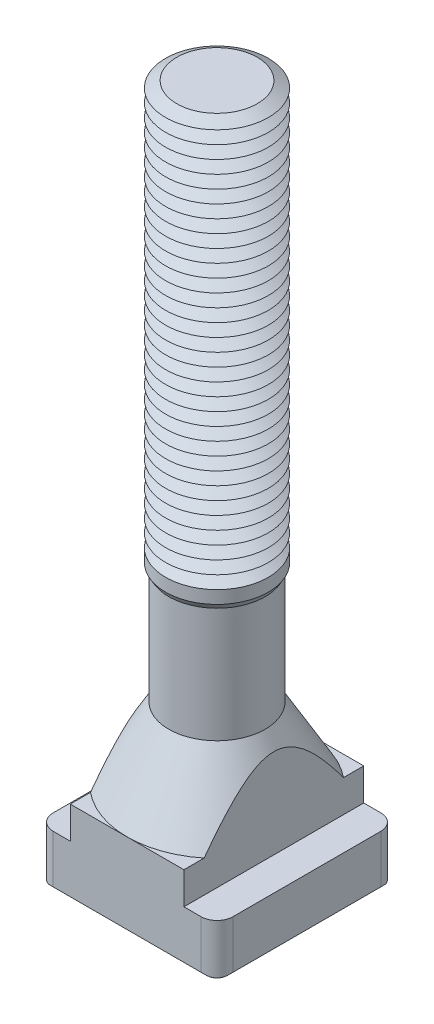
ISO-10303-21;
HEADER;
FILE_DESCRIPTION(('STEP AP214'),'2;1');
FILE_NAME('part.step','',(''),(''),'','','');
FILE_SCHEMA(('AUTOMOTIVE_DESIGN { 1 0 10303 214 1 1 1 1 }'));
ENDSEC;
DATA;
#1=APPLICATION_CONTEXT('core data for automotive mechanical design processes');
#2=APPLICATION_PROTOCOL_DEFINITION('international standard','automotive_design',2000,#1);
#3=PRODUCT_CONTEXT('',#1,'mechanical');
#4=PRODUCT('Part','Part','',(#3));
#5=PRODUCT_RELATED_PRODUCT_CATEGORY('part','',(#4));
#6=PRODUCT_DEFINITION_FORMATION('','',#4);
#7=PRODUCT_DEFINITION_CONTEXT('part definition',#1,'design');
#8=PRODUCT_DEFINITION('design','',#6,#7);
#9=PRODUCT_DEFINITION_SHAPE('','',#8);
#10=(LENGTH_UNIT() NAMED_UNIT(*) SI_UNIT(.MILLI.,.METRE.));
#11=(NAMED_UNIT(*) PLANE_ANGLE_UNIT() SI_UNIT($,.RADIAN.));
#12=(NAMED_UNIT(*) SI_UNIT($,.STERADIAN.) SOLID_ANGLE_UNIT());
#13=UNCERTAINTY_MEASURE_WITH_UNIT(LENGTH_MEASURE(1.E-05),#10,'distance_accuracy_value','');
#14=(GEOMETRIC_REPRESENTATION_CONTEXT(3) GLOBAL_UNCERTAINTY_ASSIGNED_CONTEXT((#13)) GLOBAL_UNIT_ASSIGNED_CONTEXT((#10,
#11,#12)) REPRESENTATION_CONTEXT('',''));
#15=CARTESIAN_POINT('',(0.,0.,0.));
#16=DIRECTION('',(0.,0.,1.));
#17=DIRECTION('',(1.,0.,0.));
#18=AXIS2_PLACEMENT_3D('',#15,#16,#17);
#19=CARTESIAN_POINT('',(0.,102.,0.));
#20=DIRECTION('',(0.,-1.,0.));
#21=DIRECTION('',(0.,0.,-1.));
#22=AXIS2_PLACEMENT_3D('',#19,#20,#21);
#23=CONICAL_SURFACE('',#22,6.26794919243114,1.0471975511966);
#24=CARTESIAN_POINT('',(0.,101.,0.));
#25=DIRECTION('',(0.,-1.,0.));
#26=DIRECTION('',(0.,0.,-1.));
#27=AXIS2_PLACEMENT_3D('',#24,#25,#26);
#28=CIRCLE('',#27,8.00000000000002);
#29=CARTESIAN_POINT('',(0.,101.,-8.00000000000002));
#30=VERTEX_POINT('',#29);
#31=EDGE_CURVE('E708',#30,#30,#28,.T.);
#32=ORIENTED_EDGE('',*,*,#31,.F.);
#33=EDGE_LOOP('',(#32));
#34=FACE_BOUND('',#33,.T.);
#35=CARTESIAN_POINT('',(0.,102.,0.));
#36=DIRECTION('',(0.,-1.,0.));
#37=DIRECTION('',(0.,0.,-1.));
#38=AXIS2_PLACEMENT_3D('',#35,#36,#37);
#39=CIRCLE('',#38,6.26794919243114);
#40=CARTESIAN_POINT('',(0.,102.,-6.26794919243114));
#41=VERTEX_POINT('',#40);
#42=EDGE_CURVE('E699',#41,#41,#39,.T.);
#43=ORIENTED_EDGE('',*,*,#42,.T.);
#44=EDGE_LOOP('',(#43));
#45=FACE_BOUND('',#44,.T.);
#46=ADVANCED_FACE('F39',(#34,#45),#23,.T.);
#47=CARTESIAN_POINT('',(0.,103.,0.));
#48=DIRECTION('',(0.,1.,0.));
#49=DIRECTION('',(0.,0.,1.));
#50=AXIS2_PLACEMENT_3D('',#47,#48,#49);
#51=CONICAL_SURFACE('',#50,8.00000000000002,1.0471975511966);
#52=ORIENTED_EDGE('',*,*,#42,.F.);
#53=EDGE_LOOP('',(#52));
#54=FACE_BOUND('',#53,.T.);
#55=CARTESIAN_POINT('',(0.,103.,0.));
#56=DIRECTION('',(0.,-1.,0.));
#57=DIRECTION('',(0.,0.,-1.));
#58=AXIS2_PLACEMENT_3D('',#55,#56,#57);
#59=CIRCLE('',#58,8.00000000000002);
#60=CARTESIAN_POINT('',(0.,103.,-8.00000000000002));
#61=VERTEX_POINT('',#60);
#62=EDGE_CURVE('E697',#61,#61,#59,.T.);
#63=ORIENTED_EDGE('',*,*,#62,.T.);
#64=EDGE_LOOP('',(#63));
#65=FACE_BOUND('',#64,.T.);
#66=ADVANCED_FACE('F449',(#54,#65),#51,.T.);
#67=CARTESIAN_POINT('',(3.78469427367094,110.,0.));
#68=DIRECTION('',(0.,-1.,0.));
#69=DIRECTION('',(1.,0.,0.));
#70=AXIS2_PLACEMENT_3D('',#67,#68,#69);
#71=PLANE('',#70);
#72=CARTESIAN_POINT('',(0.,110.,0.));
#73=DIRECTION('',(0.,-1.,0.));
#74=DIRECTION('',(0.,0.,-1.));
#75=AXIS2_PLACEMENT_3D('',#72,#73,#74);
#76=CIRCLE('',#75,6.26794919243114);
#77=CARTESIAN_POINT('',(0.,110.,-6.26794919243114));
#78=VERTEX_POINT('',#77);
#79=EDGE_CURVE('E678',#78,#78,#76,.T.);
#80=ORIENTED_EDGE('',*,*,#79,.F.);
#81=EDGE_LOOP('',(#80));
#82=FACE_BOUND('',#81,.T.);
#83=ADVANCED_FACE('F455',(#82),#71,.F.);
#84=CARTESIAN_POINT('',(0.,110.,0.));
#85=DIRECTION('',(0.,-1.,0.));
#86=DIRECTION('',(0.,0.,-1.));
#87=AXIS2_PLACEMENT_3D('',#84,#85,#86);
#88=CONICAL_SURFACE('',#87,6.26794919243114,1.0471975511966);
#89=CARTESIAN_POINT('',(0.,109.,0.));
#90=DIRECTION('',(0.,-1.,0.));
#91=DIRECTION('',(0.,0.,-1.));
#92=AXIS2_PLACEMENT_3D('',#89,#90,#91);
#93=CIRCLE('',#92,8.00000000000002);
#94=CARTESIAN_POINT('',(0.,109.,-8.00000000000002));
#95=VERTEX_POINT('',#94);
#96=EDGE_CURVE('E723',#95,#95,#93,.T.);
#97=ORIENTED_EDGE('',*,*,#96,.F.);
#98=EDGE_LOOP('',(#97));
#99=FACE_BOUND('',#98,.T.);
#100=ORIENTED_EDGE('',*,*,#79,.T.);
#101=EDGE_LOOP('',(#100));
#102=FACE_BOUND('',#101,.T.);
#103=ADVANCED_FACE('F483',(#99,#102),#88,.T.);
#104=CARTESIAN_POINT('',(0.,109.,0.));
#105=DIRECTION('',(0.,1.,0.));
#106=DIRECTION('',(0.,0.,1.));
#107=AXIS2_PLACEMENT_3D('',#104,#105,#106);
#108=CONICAL_SURFACE('',#107,8.00000000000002,1.0471975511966);
#109=CARTESIAN_POINT('',(0.,108.,0.));
#110=DIRECTION('',(0.,-1.,0.));
#111=DIRECTION('',(0.,0.,-1.));
#112=AXIS2_PLACEMENT_3D('',#109,#110,#111);
#113=CIRCLE('',#112,6.26794919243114);
#114=CARTESIAN_POINT('',(0.,108.,-6.26794919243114));
#115=VERTEX_POINT('',#114);
#116=EDGE_CURVE('E719',#115,#115,#113,.T.);
#117=ORIENTED_EDGE('',*,*,#116,.F.);
#118=EDGE_LOOP('',(#117));
#119=FACE_BOUND('',#118,.T.);
#120=ORIENTED_EDGE('',*,*,#96,.T.);
#121=EDGE_LOOP('',(#120));
#122=FACE_BOUND('',#121,.T.);
#123=ADVANCED_FACE('F480',(#119,#122),#108,.T.);
#124=CARTESIAN_POINT('',(0.,108.,0.));
#125=DIRECTION('',(0.,-1.,0.));
#126=DIRECTION('',(0.,0.,-1.));
#127=AXIS2_PLACEMENT_3D('',#124,#125,#126);
#128=CONICAL_SURFACE('',#127,6.26794919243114,1.0471975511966);
#129=CARTESIAN_POINT('',(0.,107.,0.));
#130=DIRECTION('',(0.,-1.,0.));
#131=DIRECTION('',(0.,0.,-1.));
#132=AXIS2_PLACEMENT_3D('',#129,#130,#131);
#133=CIRCLE('',#132,8.00000000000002);
#134=CARTESIAN_POINT('',(0.,107.,-8.00000000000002));
#135=VERTEX_POINT('',#134);
#136=EDGE_CURVE('E715',#135,#135,#133,.T.);
#137=ORIENTED_EDGE('',*,*,#136,.F.);
#138=EDGE_LOOP('',(#137));
#139=FACE_BOUND('',#138,.T.);
#140=ORIENTED_EDGE('',*,*,#116,.T.);
#141=EDGE_LOOP('',(#140));
#142=FACE_BOUND('',#141,.T.);
#143=ADVANCED_FACE('F475',(#139,#142),#128,.T.);
#144=CARTESIAN_POINT('',(0.,107.,0.));
#145=DIRECTION('',(0.,1.,0.));
#146=DIRECTION('',(0.,0.,1.));
#147=AXIS2_PLACEMENT_3D('',#144,#145,#146);
#148=CONICAL_SURFACE('',#147,8.00000000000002,1.0471975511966);
#149=CARTESIAN_POINT('',(0.,106.,0.));
#150=DIRECTION('',(0.,-1.,0.));
#151=DIRECTION('',(0.,0.,-1.));
#152=AXIS2_PLACEMENT_3D('',#149,#150,#151);
#153=CIRCLE('',#152,6.26794919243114);
#154=CARTESIAN_POINT('',(0.,106.,-6.26794919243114));
#155=VERTEX_POINT('',#154);
#156=EDGE_CURVE('E694',#155,#155,#153,.T.);
#157=ORIENTED_EDGE('',*,*,#156,.F.);
#158=EDGE_LOOP('',(#157));
#159=FACE_BOUND('',#158,.T.);
#160=ORIENTED_EDGE('',*,*,#136,.T.);
#161=EDGE_LOOP('',(#160));
#162=FACE_BOUND('',#161,.T.);
#163=ADVANCED_FACE('F472',(#159,#162),#148,.T.);
#164=CARTESIAN_POINT('',(0.,106.,0.));
#165=DIRECTION('',(0.,-1.,0.));
#166=DIRECTION('',(0.,0.,-1.));
#167=AXIS2_PLACEMENT_3D('',#164,#165,#166);
#168=CONICAL_SURFACE('',#167,6.26794919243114,1.0471975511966);
#169=CARTESIAN_POINT('',(0.,105.,0.));
#170=DIRECTION('',(0.,-1.,0.));
#171=DIRECTION('',(0.,0.,-1.));
#172=AXIS2_PLACEMENT_3D('',#169,#170,#171);
#173=CIRCLE('',#172,8.00000000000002);
#174=CARTESIAN_POINT('',(0.,105.,-8.00000000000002));
#175=VERTEX_POINT('',#174);
#176=EDGE_CURVE('E692',#175,#175,#173,.T.);
#177=ORIENTED_EDGE('',*,*,#176,.F.);
#178=EDGE_LOOP('',(#177));
#179=FACE_BOUND('',#178,.T.);
#180=ORIENTED_EDGE('',*,*,#156,.T.);
#181=EDGE_LOOP('',(#180));
#182=FACE_BOUND('',#181,.T.);
#183=ADVANCED_FACE('F466',(#179,#182),#168,.T.);
#184=CARTESIAN_POINT('',(0.,105.,0.));
#185=DIRECTION('',(0.,1.,0.));
#186=DIRECTION('',(0.,0.,1.));
#187=AXIS2_PLACEMENT_3D('',#184,#185,#186);
#188=CONICAL_SURFACE('',#187,8.00000000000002,1.0471975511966);
#189=CARTESIAN_POINT('',(0.,104.,0.));
#190=DIRECTION('',(0.,-1.,0.));
#191=DIRECTION('',(0.,0.,-1.));
#192=AXIS2_PLACEMENT_3D('',#189,#190,#191);
#193=CIRCLE('',#192,6.26794919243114);
#194=CARTESIAN_POINT('',(0.,104.,-6.26794919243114));
#195=VERTEX_POINT('',#194);
#196=EDGE_CURVE('E695',#195,#195,#193,.T.);
#197=ORIENTED_EDGE('',*,*,#196,.F.);
#198=EDGE_LOOP('',(#197));
#199=FACE_BOUND('',#198,.T.);
#200=ORIENTED_EDGE('',*,*,#176,.T.);
#201=EDGE_LOOP('',(#200));
#202=FACE_BOUND('',#201,.T.);
#203=ADVANCED_FACE('F462',(#199,#202),#188,.T.);
#204=CARTESIAN_POINT('',(0.,104.,0.));
#205=DIRECTION('',(0.,-1.,0.));
#206=DIRECTION('',(0.,0.,-1.));
#207=AXIS2_PLACEMENT_3D('',#204,#205,#206);
#208=CONICAL_SURFACE('',#207,6.26794919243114,1.0471975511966);
#209=ORIENTED_EDGE('',*,*,#62,.F.);
#210=EDGE_LOOP('',(#209));
#211=FACE_BOUND('',#210,.T.);
#212=ORIENTED_EDGE('',*,*,#196,.T.);
#213=EDGE_LOOP('',(#212));
#214=FACE_BOUND('',#213,.T.);
#215=ADVANCED_FACE('F465',(#211,#214),#208,.T.);
#216=CARTESIAN_POINT('',(0.,100.,0.));
#217=DIRECTION('',(0.,-1.,0.));
#218=DIRECTION('',(0.,0.,-1.));
#219=AXIS2_PLACEMENT_3D('',#216,#217,#218);
#220=CONICAL_SURFACE('',#219,6.26794919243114,1.0471975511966);
#221=CARTESIAN_POINT('',(0.,99.,0.));
#222=DIRECTION('',(0.,-1.,0.));
#223=DIRECTION('',(0.,0.,-1.));
#224=AXIS2_PLACEMENT_3D('',#221,#222,#223);
#225=CIRCLE('',#224,8.00000000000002);
#226=CARTESIAN_POINT('',(0.,99.,-8.00000000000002));
#227=VERTEX_POINT('',#226);
#228=EDGE_CURVE('E771',#227,#227,#225,.T.);
#229=ORIENTED_EDGE('',*,*,#228,.F.);
#230=EDGE_LOOP('',(#229));
#231=FACE_BOUND('',#230,.T.);
#232=CARTESIAN_POINT('',(0.,100.,0.));
#233=DIRECTION('',(0.,-1.,0.));
#234=DIRECTION('',(0.,0.,-1.));
#235=AXIS2_PLACEMENT_3D('',#232,#233,#234);
#236=CIRCLE('',#235,6.26794919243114);
#237=CARTESIAN_POINT('',(0.,100.,-6.26794919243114));
#238=VERTEX_POINT('',#237);
#239=EDGE_CURVE('E774',#238,#238,#236,.T.);
#240=ORIENTED_EDGE('',*,*,#239,.T.);
#241=EDGE_LOOP('',(#240));
#242=FACE_BOUND('',#241,.T.);
#243=ADVANCED_FACE('F470',(#231,#242),#220,.T.);
#244=CARTESIAN_POINT('',(0.,101.,0.));
#245=DIRECTION('',(0.,1.,0.));
#246=DIRECTION('',(0.,0.,1.));
#247=AXIS2_PLACEMENT_3D('',#244,#245,#246);
#248=CONICAL_SURFACE('',#247,8.00000000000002,1.0471975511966);
#249=ORIENTED_EDGE('',*,*,#239,.F.);
#250=EDGE_LOOP('',(#249));
#251=FACE_BOUND('',#250,.T.);
#252=ORIENTED_EDGE('',*,*,#31,.T.);
#253=EDGE_LOOP('',(#252));
#254=FACE_BOUND('',#253,.T.);
#255=ADVANCED_FACE('F780',(#251,#254),#248,.T.);
#256=CARTESIAN_POINT('',(0.,98.,0.));
#257=DIRECTION('',(0.,-1.,0.));
#258=DIRECTION('',(0.,0.,-1.));
#259=AXIS2_PLACEMENT_3D('',#256,#257,#258);
#260=CONICAL_SURFACE('',#259,6.26794919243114,1.0471975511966);
#261=CARTESIAN_POINT('',(0.,97.,0.));
#262=DIRECTION('',(0.,-1.,0.));
#263=DIRECTION('',(0.,0.,-1.));
#264=AXIS2_PLACEMENT_3D('',#261,#262,#263);
#265=CIRCLE('',#264,8.00000000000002);
#266=CARTESIAN_POINT('',(0.,97.,-8.00000000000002));
#267=VERTEX_POINT('',#266);
#268=EDGE_CURVE('E653',#267,#267,#265,.T.);
#269=ORIENTED_EDGE('',*,*,#268,.F.);
#270=EDGE_LOOP('',(#269));
#271=FACE_BOUND('',#270,.T.);
#272=CARTESIAN_POINT('',(0.,98.,0.));
#273=DIRECTION('',(0.,-1.,0.));
#274=DIRECTION('',(0.,0.,-1.));
#275=AXIS2_PLACEMENT_3D('',#272,#273,#274);
#276=CIRCLE('',#275,6.26794919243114);
#277=CARTESIAN_POINT('',(0.,98.,-6.26794919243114));
#278=VERTEX_POINT('',#277);
#279=EDGE_CURVE('E656',#278,#278,#276,.T.);
#280=ORIENTED_EDGE('',*,*,#279,.T.);
#281=EDGE_LOOP('',(#280));
#282=FACE_BOUND('',#281,.T.);
#283=ADVANCED_FACE('F782',(#271,#282),#260,.T.);
#284=CARTESIAN_POINT('',(0.,99.,0.));
#285=DIRECTION('',(0.,1.,0.));
#286=DIRECTION('',(0.,0.,1.));
#287=AXIS2_PLACEMENT_3D('',#284,#285,#286);
#288=CONICAL_SURFACE('',#287,8.00000000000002,1.0471975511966);
#289=ORIENTED_EDGE('',*,*,#279,.F.);
#290=EDGE_LOOP('',(#289));
#291=FACE_BOUND('',#290,.T.);
#292=ORIENTED_EDGE('',*,*,#228,.T.);
#293=EDGE_LOOP('',(#292));
#294=FACE_BOUND('',#293,.T.);
#295=ADVANCED_FACE('F789',(#291,#294),#288,.T.);
#296=CARTESIAN_POINT('',(0.,96.,0.));
#297=DIRECTION('',(0.,-1.,0.));
#298=DIRECTION('',(0.,0.,-1.));
#299=AXIS2_PLACEMENT_3D('',#296,#297,#298);
#300=CONICAL_SURFACE('',#299,6.26794919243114,1.0471975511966);
#301=CARTESIAN_POINT('',(0.,95.,0.));
#302=DIRECTION('',(0.,-1.,0.));
#303=DIRECTION('',(0.,0.,-1.));
#304=AXIS2_PLACEMENT_3D('',#301,#302,#303);
#305=CIRCLE('',#304,8.00000000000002);
#306=CARTESIAN_POINT('',(0.,95.,-8.00000000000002));
#307=VERTEX_POINT('',#306);
#308=EDGE_CURVE('E754',#307,#307,#305,.T.);
#309=ORIENTED_EDGE('',*,*,#308,.F.);
#310=EDGE_LOOP('',(#309));
#311=FACE_BOUND('',#310,.T.);
#312=CARTESIAN_POINT('',(0.,96.,0.));
#313=DIRECTION('',(0.,-1.,0.));
#314=DIRECTION('',(0.,0.,-1.));
#315=AXIS2_PLACEMENT_3D('',#312,#313,#314);
#316=CIRCLE('',#315,6.26794919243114);
#317=CARTESIAN_POINT('',(0.,96.,-6.26794919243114));
#318=VERTEX_POINT('',#317);
#319=EDGE_CURVE('E657',#318,#318,#316,.T.);
#320=ORIENTED_EDGE('',*,*,#319,.T.);
#321=EDGE_LOOP('',(#320));
#322=FACE_BOUND('',#321,.T.);
#323=ADVANCED_FACE('F797',(#311,#322),#300,.T.);
#324=CARTESIAN_POINT('',(0.,97.,0.));
#325=DIRECTION('',(0.,1.,0.));
#326=DIRECTION('',(0.,0.,1.));
#327=AXIS2_PLACEMENT_3D('',#324,#325,#326);
#328=CONICAL_SURFACE('',#327,8.00000000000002,1.0471975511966);
#329=ORIENTED_EDGE('',*,*,#319,.F.);
#330=EDGE_LOOP('',(#329));
#331=FACE_BOUND('',#330,.T.);
#332=ORIENTED_EDGE('',*,*,#268,.T.);
#333=EDGE_LOOP('',(#332));
#334=FACE_BOUND('',#333,.T.);
#335=ADVANCED_FACE('F801',(#331,#334),#328,.T.);
#336=CARTESIAN_POINT('',(0.,94.,0.));
#337=DIRECTION('',(0.,-1.,0.));
#338=DIRECTION('',(0.,0.,-1.));
#339=AXIS2_PLACEMENT_3D('',#336,#337,#338);
#340=CONICAL_SURFACE('',#339,6.26794919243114,1.0471975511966);
#341=CARTESIAN_POINT('',(0.,93.,0.));
#342=DIRECTION('',(0.,-1.,0.));
#343=DIRECTION('',(0.,0.,-1.));
#344=AXIS2_PLACEMENT_3D('',#341,#342,#343);
#345=CIRCLE('',#344,8.00000000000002);
#346=CARTESIAN_POINT('',(0.,93.,-8.00000000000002));
#347=VERTEX_POINT('',#346);
#348=EDGE_CURVE('E751',#347,#347,#345,.T.);
#349=ORIENTED_EDGE('',*,*,#348,.F.);
#350=EDGE_LOOP('',(#349));
#351=FACE_BOUND('',#350,.T.);
#352=CARTESIAN_POINT('',(0.,94.,0.));
#353=DIRECTION('',(0.,-1.,0.));
#354=DIRECTION('',(0.,0.,-1.));
#355=AXIS2_PLACEMENT_3D('',#352,#353,#354);
#356=CIRCLE('',#355,6.26794919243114);
#357=CARTESIAN_POINT('',(0.,94.,-6.26794919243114));
#358=VERTEX_POINT('',#357);
#359=EDGE_CURVE('E756',#358,#358,#356,.T.);
#360=ORIENTED_EDGE('',*,*,#359,.T.);
#361=EDGE_LOOP('',(#360));
#362=FACE_BOUND('',#361,.T.);
#363=ADVANCED_FACE('F805',(#351,#362),#340,.T.);
#364=CARTESIAN_POINT('',(0.,95.,0.));
#365=DIRECTION('',(0.,1.,0.));
#366=DIRECTION('',(0.,0.,1.));
#367=AXIS2_PLACEMENT_3D('',#364,#365,#366);
#368=CONICAL_SURFACE('',#367,8.00000000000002,1.0471975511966);
#369=ORIENTED_EDGE('',*,*,#359,.F.);
#370=EDGE_LOOP('',(#369));
#371=FACE_BOUND('',#370,.T.);
#372=ORIENTED_EDGE('',*,*,#308,.T.);
#373=EDGE_LOOP('',(#372));
#374=FACE_BOUND('',#373,.T.);
#375=ADVANCED_FACE('F809',(#371,#374),#368,.T.);
#376=CARTESIAN_POINT('',(0.,92.,0.));
#377=DIRECTION('',(0.,-1.,0.));
#378=DIRECTION('',(0.,0.,-1.));
#379=AXIS2_PLACEMENT_3D('',#376,#377,#378);
#380=CONICAL_SURFACE('',#379,6.26794919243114,1.0471975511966);
#381=CARTESIAN_POINT('',(0.,91.,0.));
#382=DIRECTION('',(0.,-1.,0.));
#383=DIRECTION('',(0.,0.,-1.));
#384=AXIS2_PLACEMENT_3D('',#381,#382,#383);
#385=CIRCLE('',#384,8.00000000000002);
#386=CARTESIAN_POINT('',(0.,91.,-8.00000000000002));
#387=VERTEX_POINT('',#386);
#388=EDGE_CURVE('E752',#387,#387,#385,.T.);
#389=ORIENTED_EDGE('',*,*,#388,.F.);
#390=EDGE_LOOP('',(#389));
#391=FACE_BOUND('',#390,.T.);
#392=CARTESIAN_POINT('',(0.,92.,0.));
#393=DIRECTION('',(0.,-1.,0.));
#394=DIRECTION('',(0.,0.,-1.));
#395=AXIS2_PLACEMENT_3D('',#392,#393,#394);
#396=CIRCLE('',#395,6.26794919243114);
#397=CARTESIAN_POINT('',(0.,92.,-6.26794919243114));
#398=VERTEX_POINT('',#397);
#399=EDGE_CURVE('E748',#398,#398,#396,.T.);
#400=ORIENTED_EDGE('',*,*,#399,.T.);
#401=EDGE_LOOP('',(#400));
#402=FACE_BOUND('',#401,.T.);
#403=ADVANCED_FACE('F813',(#391,#402),#380,.T.);
#404=CARTESIAN_POINT('',(0.,93.,0.));
#405=DIRECTION('',(0.,1.,0.));
#406=DIRECTION('',(0.,0.,1.));
#407=AXIS2_PLACEMENT_3D('',#404,#405,#406);
#408=CONICAL_SURFACE('',#407,8.00000000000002,1.0471975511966);
#409=ORIENTED_EDGE('',*,*,#399,.F.);
#410=EDGE_LOOP('',(#409));
#411=FACE_BOUND('',#410,.T.);
#412=ORIENTED_EDGE('',*,*,#348,.T.);
#413=EDGE_LOOP('',(#412));
#414=FACE_BOUND('',#413,.T.);
#415=ADVANCED_FACE('F817',(#411,#414),#408,.T.);
#416=CARTESIAN_POINT('',(0.,90.,0.));
#417=DIRECTION('',(0.,-1.,0.));
#418=DIRECTION('',(0.,0.,-1.));
#419=AXIS2_PLACEMENT_3D('',#416,#417,#418);
#420=CONICAL_SURFACE('',#419,6.26794919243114,1.0471975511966);
#421=CARTESIAN_POINT('',(0.,89.,0.));
#422=DIRECTION('',(0.,-1.,0.));
#423=DIRECTION('',(0.,0.,-1.));
#424=AXIS2_PLACEMENT_3D('',#421,#422,#423);
#425=CIRCLE('',#424,8.00000000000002);
#426=CARTESIAN_POINT('',(0.,89.,-8.00000000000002));
#427=VERTEX_POINT('',#426);
#428=EDGE_CURVE('E1111',#427,#427,#425,.T.);
#429=ORIENTED_EDGE('',*,*,#428,.F.);
#430=EDGE_LOOP('',(#429));
#431=FACE_BOUND('',#430,.T.);
#432=CARTESIAN_POINT('',(0.,90.,0.));
#433=DIRECTION('',(0.,-1.,0.));
#434=DIRECTION('',(0.,0.,-1.));
#435=AXIS2_PLACEMENT_3D('',#432,#433,#434);
#436=CIRCLE('',#435,6.26794919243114);
#437=CARTESIAN_POINT('',(0.,90.,-6.26794919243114));
#438=VERTEX_POINT('',#437);
#439=EDGE_CURVE('E1115',#438,#438,#436,.T.);
#440=ORIENTED_EDGE('',*,*,#439,.T.);
#441=EDGE_LOOP('',(#440));
#442=FACE_BOUND('',#441,.T.);
#443=ADVANCED_FACE('F821',(#431,#442),#420,.T.);
#444=CARTESIAN_POINT('',(0.,91.,0.));
#445=DIRECTION('',(0.,1.,0.));
#446=DIRECTION('',(0.,0.,1.));
#447=AXIS2_PLACEMENT_3D('',#444,#445,#446);
#448=CONICAL_SURFACE('',#447,8.00000000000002,1.0471975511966);
#449=ORIENTED_EDGE('',*,*,#439,.F.);
#450=EDGE_LOOP('',(#449));
#451=FACE_BOUND('',#450,.T.);
#452=ORIENTED_EDGE('',*,*,#388,.T.);
#453=EDGE_LOOP('',(#452));
#454=FACE_BOUND('',#453,.T.);
#455=ADVANCED_FACE('F825',(#451,#454),#448,.T.);
#456=CARTESIAN_POINT('',(0.,88.,0.));
#457=DIRECTION('',(0.,-1.,0.));
#458=DIRECTION('',(0.,0.,-1.));
#459=AXIS2_PLACEMENT_3D('',#456,#457,#458);
#460=CONICAL_SURFACE('',#459,6.26794919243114,1.0471975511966);
#461=CARTESIAN_POINT('',(0.,87.,0.));
#462=DIRECTION('',(0.,-1.,0.));
#463=DIRECTION('',(0.,0.,-1.));
#464=AXIS2_PLACEMENT_3D('',#461,#462,#463);
#465=CIRCLE('',#464,8.00000000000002);
#466=CARTESIAN_POINT('',(0.,87.,-8.00000000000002));
#467=VERTEX_POINT('',#466);
#468=EDGE_CURVE('E669',#467,#467,#465,.T.);
#469=ORIENTED_EDGE('',*,*,#468,.F.);
#470=EDGE_LOOP('',(#469));
#471=FACE_BOUND('',#470,.T.);
#472=CARTESIAN_POINT('',(0.,88.,0.));
#473=DIRECTION('',(0.,-1.,0.));
#474=DIRECTION('',(0.,0.,-1.));
#475=AXIS2_PLACEMENT_3D('',#472,#473,#474);
#476=CIRCLE('',#475,6.26794919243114);
#477=CARTESIAN_POINT('',(0.,88.,-6.26794919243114));
#478=VERTEX_POINT('',#477);
#479=EDGE_CURVE('E672',#478,#478,#476,.T.);
#480=ORIENTED_EDGE('',*,*,#479,.T.);
#481=EDGE_LOOP('',(#480));
#482=FACE_BOUND('',#481,.T.);
#483=ADVANCED_FACE('F829',(#471,#482),#460,.T.);
#484=CARTESIAN_POINT('',(0.,89.,0.));
#485=DIRECTION('',(0.,1.,0.));
#486=DIRECTION('',(0.,0.,1.));
#487=AXIS2_PLACEMENT_3D('',#484,#485,#486);
#488=CONICAL_SURFACE('',#487,8.00000000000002,1.0471975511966);
#489=ORIENTED_EDGE('',*,*,#479,.F.);
#490=EDGE_LOOP('',(#489));
#491=FACE_BOUND('',#490,.T.);
#492=ORIENTED_EDGE('',*,*,#428,.T.);
#493=EDGE_LOOP('',(#492));
#494=FACE_BOUND('',#493,.T.);
#495=ADVANCED_FACE('F833',(#491,#494),#488,.T.);
#496=CARTESIAN_POINT('',(0.,86.,0.));
#497=DIRECTION('',(0.,-1.,0.));
#498=DIRECTION('',(0.,0.,-1.));
#499=AXIS2_PLACEMENT_3D('',#496,#497,#498);
#500=CONICAL_SURFACE('',#499,6.26794919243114,1.0471975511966);
#501=CARTESIAN_POINT('',(0.,85.,0.));
#502=DIRECTION('',(0.,-1.,0.));
#503=DIRECTION('',(0.,0.,-1.));
#504=AXIS2_PLACEMENT_3D('',#501,#502,#503);
#505=CIRCLE('',#504,8.00000000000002);
#506=CARTESIAN_POINT('',(0.,85.,-8.00000000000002));
#507=VERTEX_POINT('',#506);
#508=EDGE_CURVE('E1101',#507,#507,#505,.T.);
#509=ORIENTED_EDGE('',*,*,#508,.F.);
#510=EDGE_LOOP('',(#509));
#511=FACE_BOUND('',#510,.T.);
#512=CARTESIAN_POINT('',(0.,86.,0.));
#513=DIRECTION('',(0.,-1.,0.));
#514=DIRECTION('',(0.,0.,-1.));
#515=AXIS2_PLACEMENT_3D('',#512,#513,#514);
#516=CIRCLE('',#515,6.26794919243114);
#517=CARTESIAN_POINT('',(0.,86.,-6.26794919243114));
#518=VERTEX_POINT('',#517);
#519=EDGE_CURVE('E673',#518,#518,#516,.T.);
#520=ORIENTED_EDGE('',*,*,#519,.T.);
#521=EDGE_LOOP('',(#520));
#522=FACE_BOUND('',#521,.T.);
#523=ADVANCED_FACE('F837',(#511,#522),#500,.T.);
#524=CARTESIAN_POINT('',(0.,87.,0.));
#525=DIRECTION('',(0.,1.,0.));
#526=DIRECTION('',(0.,0.,1.));
#527=AXIS2_PLACEMENT_3D('',#524,#525,#526);
#528=CONICAL_SURFACE('',#527,8.00000000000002,1.0471975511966);
#529=ORIENTED_EDGE('',*,*,#519,.F.);
#530=EDGE_LOOP('',(#529));
#531=FACE_BOUND('',#530,.T.);
#532=ORIENTED_EDGE('',*,*,#468,.T.);
#533=EDGE_LOOP('',(#532));
#534=FACE_BOUND('',#533,.T.);
#535=ADVANCED_FACE('F841',(#531,#534),#528,.T.);
#536=CARTESIAN_POINT('',(0.,84.,0.));
#537=DIRECTION('',(0.,-1.,0.));
#538=DIRECTION('',(0.,0.,-1.));
#539=AXIS2_PLACEMENT_3D('',#536,#537,#538);
#540=CONICAL_SURFACE('',#539,6.26794919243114,1.0471975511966);
#541=CARTESIAN_POINT('',(0.,83.,0.));
#542=DIRECTION('',(0.,-1.,0.));
#543=DIRECTION('',(0.,0.,-1.));
#544=AXIS2_PLACEMENT_3D('',#541,#542,#543);
#545=CIRCLE('',#544,8.00000000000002);
#546=CARTESIAN_POINT('',(0.,83.,-8.00000000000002));
#547=VERTEX_POINT('',#546);
#548=EDGE_CURVE('E632',#547,#547,#545,.T.);
#549=ORIENTED_EDGE('',*,*,#548,.F.);
#550=EDGE_LOOP('',(#549));
#551=FACE_BOUND('',#550,.T.);
#552=CARTESIAN_POINT('',(0.,84.,0.));
#553=DIRECTION('',(0.,-1.,0.));
#554=DIRECTION('',(0.,0.,-1.));
#555=AXIS2_PLACEMENT_3D('',#552,#553,#554);
#556=CIRCLE('',#555,6.26794919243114);
#557=CARTESIAN_POINT('',(0.,84.,-6.26794919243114));
#558=VERTEX_POINT('',#557);
#559=EDGE_CURVE('E1097',#558,#558,#556,.T.);
#560=ORIENTED_EDGE('',*,*,#559,.T.);
#561=EDGE_LOOP('',(#560));
#562=FACE_BOUND('',#561,.T.);
#563=ADVANCED_FACE('F845',(#551,#562),#540,.T.);
#564=CARTESIAN_POINT('',(0.,85.,0.));
#565=DIRECTION('',(0.,1.,0.));
#566=DIRECTION('',(0.,0.,1.));
#567=AXIS2_PLACEMENT_3D('',#564,#565,#566);
#568=CONICAL_SURFACE('',#567,8.00000000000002,1.0471975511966);
#569=ORIENTED_EDGE('',*,*,#559,.F.);
#570=EDGE_LOOP('',(#569));
#571=FACE_BOUND('',#570,.T.);
#572=ORIENTED_EDGE('',*,*,#508,.T.);
#573=EDGE_LOOP('',(#572));
#574=FACE_BOUND('',#573,.T.);
#575=ADVANCED_FACE('F849',(#571,#574),#568,.T.);
#576=CARTESIAN_POINT('',(0.,82.,0.));
#577=DIRECTION('',(0.,-1.,0.));
#578=DIRECTION('',(0.,0.,-1.));
#579=AXIS2_PLACEMENT_3D('',#576,#577,#578);
#580=CONICAL_SURFACE('',#579,6.26794919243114,1.0471975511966);
#581=CARTESIAN_POINT('',(0.,81.,0.));
#582=DIRECTION('',(0.,-1.,0.));
#583=DIRECTION('',(0.,0.,-1.));
#584=AXIS2_PLACEMENT_3D('',#581,#582,#583);
#585=CIRCLE('',#584,8.00000000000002);
#586=CARTESIAN_POINT('',(0.,81.,-8.00000000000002));
#587=VERTEX_POINT('',#586);
#588=EDGE_CURVE('E1087',#587,#587,#585,.T.);
#589=ORIENTED_EDGE('',*,*,#588,.F.);
#590=EDGE_LOOP('',(#589));
#591=FACE_BOUND('',#590,.T.);
#592=CARTESIAN_POINT('',(0.,82.,0.));
#593=DIRECTION('',(0.,-1.,0.));
#594=DIRECTION('',(0.,0.,-1.));
#595=AXIS2_PLACEMENT_3D('',#592,#593,#594);
#596=CIRCLE('',#595,6.26794919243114);
#597=CARTESIAN_POINT('',(0.,82.,-6.26794919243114));
#598=VERTEX_POINT('',#597);
#599=EDGE_CURVE('E1091',#598,#598,#596,.T.);
#600=ORIENTED_EDGE('',*,*,#599,.T.);
#601=EDGE_LOOP('',(#600));
#602=FACE_BOUND('',#601,.T.);
#603=ADVANCED_FACE('F853',(#591,#602),#580,.T.);
#604=CARTESIAN_POINT('',(0.,83.,0.));
#605=DIRECTION('',(0.,1.,0.));
#606=DIRECTION('',(0.,0.,1.));
#607=AXIS2_PLACEMENT_3D('',#604,#605,#606);
#608=CONICAL_SURFACE('',#607,8.00000000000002,1.0471975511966);
#609=ORIENTED_EDGE('',*,*,#599,.F.);
#610=EDGE_LOOP('',(#609));
#611=FACE_BOUND('',#610,.T.);
#612=ORIENTED_EDGE('',*,*,#548,.T.);
#613=EDGE_LOOP('',(#612));
#614=FACE_BOUND('',#613,.T.);
#615=ADVANCED_FACE('F857',(#611,#614),#608,.T.);
#616=CARTESIAN_POINT('',(0.,80.,0.));
#617=DIRECTION('',(0.,-1.,0.));
#618=DIRECTION('',(0.,0.,-1.));
#619=AXIS2_PLACEMENT_3D('',#616,#617,#618);
#620=CONICAL_SURFACE('',#619,6.26794919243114,1.0471975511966);
#621=CARTESIAN_POINT('',(0.,79.,0.));
#622=DIRECTION('',(0.,-1.,0.));
#623=DIRECTION('',(0.,0.,-1.));
#624=AXIS2_PLACEMENT_3D('',#621,#622,#623);
#625=CIRCLE('',#624,8.00000000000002);
#626=CARTESIAN_POINT('',(0.,79.,-8.00000000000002));
#627=VERTEX_POINT('',#626);
#628=EDGE_CURVE('E1079',#627,#627,#625,.T.);
#629=ORIENTED_EDGE('',*,*,#628,.F.);
#630=EDGE_LOOP('',(#629));
#631=FACE_BOUND('',#630,.T.);
#632=CARTESIAN_POINT('',(0.,80.,0.));
#633=DIRECTION('',(0.,-1.,0.));
#634=DIRECTION('',(0.,0.,-1.));
#635=AXIS2_PLACEMENT_3D('',#632,#633,#634);
#636=CIRCLE('',#635,6.26794919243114);
#637=CARTESIAN_POINT('',(0.,80.,-6.26794919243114));
#638=VERTEX_POINT('',#637);
#639=EDGE_CURVE('E1083',#638,#638,#636,.T.);
#640=ORIENTED_EDGE('',*,*,#639,.T.);
#641=EDGE_LOOP('',(#640));
#642=FACE_BOUND('',#641,.T.);
#643=ADVANCED_FACE('F861',(#631,#642),#620,.T.);
#644=CARTESIAN_POINT('',(0.,81.,0.));
#645=DIRECTION('',(0.,1.,0.));
#646=DIRECTION('',(0.,0.,1.));
#647=AXIS2_PLACEMENT_3D('',#644,#645,#646);
#648=CONICAL_SURFACE('',#647,8.00000000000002,1.0471975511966);
#649=ORIENTED_EDGE('',*,*,#639,.F.);
#650=EDGE_LOOP('',(#649));
#651=FACE_BOUND('',#650,.T.);
#652=ORIENTED_EDGE('',*,*,#588,.T.);
#653=EDGE_LOOP('',(#652));
#654=FACE_BOUND('',#653,.T.);
#655=ADVANCED_FACE('F865',(#651,#654),#648,.T.);
#656=CARTESIAN_POINT('',(0.,78.,0.));
#657=DIRECTION('',(0.,-1.,0.));
#658=DIRECTION('',(0.,0.,-1.));
#659=AXIS2_PLACEMENT_3D('',#656,#657,#658);
#660=CONICAL_SURFACE('',#659,6.26794919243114,1.0471975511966);
#661=CARTESIAN_POINT('',(0.,77.,0.));
#662=DIRECTION('',(0.,-1.,0.));
#663=DIRECTION('',(0.,0.,-1.));
#664=AXIS2_PLACEMENT_3D('',#661,#662,#663);
#665=CIRCLE('',#664,8.00000000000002);
#666=CARTESIAN_POINT('',(0.,77.,-8.00000000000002));
#667=VERTEX_POINT('',#666);
#668=EDGE_CURVE('E686',#667,#667,#665,.T.);
#669=ORIENTED_EDGE('',*,*,#668,.F.);
#670=EDGE_LOOP('',(#669));
#671=FACE_BOUND('',#670,.T.);
#672=CARTESIAN_POINT('',(0.,78.,0.));
#673=DIRECTION('',(0.,-1.,0.));
#674=DIRECTION('',(0.,0.,-1.));
#675=AXIS2_PLACEMENT_3D('',#672,#673,#674);
#676=CIRCLE('',#675,6.26794919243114);
#677=CARTESIAN_POINT('',(0.,78.,-6.26794919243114));
#678=VERTEX_POINT('',#677);
#679=EDGE_CURVE('E689',#678,#678,#676,.T.);
#680=ORIENTED_EDGE('',*,*,#679,.T.);
#681=EDGE_LOOP('',(#680));
#682=FACE_BOUND('',#681,.T.);
#683=ADVANCED_FACE('F869',(#671,#682),#660,.T.);
#684=CARTESIAN_POINT('',(0.,79.,0.));
#685=DIRECTION('',(0.,1.,0.));
#686=DIRECTION('',(0.,0.,1.));
#687=AXIS2_PLACEMENT_3D('',#684,#685,#686);
#688=CONICAL_SURFACE('',#687,8.00000000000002,1.0471975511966);
#689=ORIENTED_EDGE('',*,*,#679,.F.);
#690=EDGE_LOOP('',(#689));
#691=FACE_BOUND('',#690,.T.);
#692=ORIENTED_EDGE('',*,*,#628,.T.);
#693=EDGE_LOOP('',(#692));
#694=FACE_BOUND('',#693,.T.);
#695=ADVANCED_FACE('F873',(#691,#694),#688,.T.);
#696=CARTESIAN_POINT('',(0.,76.,0.));
#697=DIRECTION('',(0.,-1.,0.));
#698=DIRECTION('',(0.,0.,-1.));
#699=AXIS2_PLACEMENT_3D('',#696,#697,#698);
#700=CONICAL_SURFACE('',#699,6.26794919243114,1.0471975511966);
#701=CARTESIAN_POINT('',(0.,75.,0.));
#702=DIRECTION('',(0.,-1.,0.));
#703=DIRECTION('',(0.,0.,-1.));
#704=AXIS2_PLACEMENT_3D('',#701,#702,#703);
#705=CIRCLE('',#704,8.00000000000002);
#706=CARTESIAN_POINT('',(0.,75.,-8.00000000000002));
#707=VERTEX_POINT('',#706);
#708=EDGE_CURVE('E1069',#707,#707,#705,.T.);
#709=ORIENTED_EDGE('',*,*,#708,.F.);
#710=EDGE_LOOP('',(#709));
#711=FACE_BOUND('',#710,.T.);
#712=CARTESIAN_POINT('',(0.,76.,0.));
#713=DIRECTION('',(0.,-1.,0.));
#714=DIRECTION('',(0.,0.,-1.));
#715=AXIS2_PLACEMENT_3D('',#712,#713,#714);
#716=CIRCLE('',#715,6.26794919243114);
#717=CARTESIAN_POINT('',(0.,76.,-6.26794919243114));
#718=VERTEX_POINT('',#717);
#719=EDGE_CURVE('E690',#718,#718,#716,.T.);
#720=ORIENTED_EDGE('',*,*,#719,.T.);
#721=EDGE_LOOP('',(#720));
#722=FACE_BOUND('',#721,.T.);
#723=ADVANCED_FACE('F877',(#711,#722),#700,.T.);
#724=CARTESIAN_POINT('',(0.,77.,0.));
#725=DIRECTION('',(0.,1.,0.));
#726=DIRECTION('',(0.,0.,1.));
#727=AXIS2_PLACEMENT_3D('',#724,#725,#726);
#728=CONICAL_SURFACE('',#727,8.00000000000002,1.0471975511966);
#729=ORIENTED_EDGE('',*,*,#719,.F.);
#730=EDGE_LOOP('',(#729));
#731=FACE_BOUND('',#730,.T.);
#732=ORIENTED_EDGE('',*,*,#668,.T.);
#733=EDGE_LOOP('',(#732));
#734=FACE_BOUND('',#733,.T.);
#735=ADVANCED_FACE('F881',(#731,#734),#728,.T.);
#736=CARTESIAN_POINT('',(0.,74.,0.));
#737=DIRECTION('',(0.,-1.,0.));
#738=DIRECTION('',(0.,0.,-1.));
#739=AXIS2_PLACEMENT_3D('',#736,#737,#738);
#740=CONICAL_SURFACE('',#739,6.26794919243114,1.0471975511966);
#741=CARTESIAN_POINT('',(0.,73.,0.));
#742=DIRECTION('',(0.,-1.,0.));
#743=DIRECTION('',(0.,0.,-1.));
#744=AXIS2_PLACEMENT_3D('',#741,#742,#743);
#745=CIRCLE('',#744,8.00000000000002);
#746=CARTESIAN_POINT('',(0.,73.,-8.00000000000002));
#747=VERTEX_POINT('',#746);
#748=EDGE_CURVE('E647',#747,#747,#745,.T.);
#749=ORIENTED_EDGE('',*,*,#748,.F.);
#750=EDGE_LOOP('',(#749));
#751=FACE_BOUND('',#750,.T.);
#752=CARTESIAN_POINT('',(0.,74.,0.));
#753=DIRECTION('',(0.,-1.,0.));
#754=DIRECTION('',(0.,0.,-1.));
#755=AXIS2_PLACEMENT_3D('',#752,#753,#754);
#756=CIRCLE('',#755,6.26794919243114);
#757=CARTESIAN_POINT('',(0.,74.,-6.26794919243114));
#758=VERTEX_POINT('',#757);
#759=EDGE_CURVE('E650',#758,#758,#756,.T.);
#760=ORIENTED_EDGE('',*,*,#759,.T.);
#761=EDGE_LOOP('',(#760));
#762=FACE_BOUND('',#761,.T.);
#763=ADVANCED_FACE('F885',(#751,#762),#740,.T.);
#764=CARTESIAN_POINT('',(0.,75.,0.));
#765=DIRECTION('',(0.,1.,0.));
#766=DIRECTION('',(0.,0.,1.));
#767=AXIS2_PLACEMENT_3D('',#764,#765,#766);
#768=CONICAL_SURFACE('',#767,8.00000000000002,1.0471975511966);
#769=ORIENTED_EDGE('',*,*,#759,.F.);
#770=EDGE_LOOP('',(#769));
#771=FACE_BOUND('',#770,.T.);
#772=ORIENTED_EDGE('',*,*,#708,.T.);
#773=EDGE_LOOP('',(#772));
#774=FACE_BOUND('',#773,.T.);
#775=ADVANCED_FACE('F889',(#771,#774),#768,.T.);
#776=CARTESIAN_POINT('',(0.,72.,0.));
#777=DIRECTION('',(0.,-1.,0.));
#778=DIRECTION('',(0.,0.,-1.));
#779=AXIS2_PLACEMENT_3D('',#776,#777,#778);
#780=CONICAL_SURFACE('',#779,6.26794919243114,1.0471975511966);
#781=CARTESIAN_POINT('',(0.,71.,0.));
#782=DIRECTION('',(0.,-1.,0.));
#783=DIRECTION('',(0.,0.,-1.));
#784=AXIS2_PLACEMENT_3D('',#781,#782,#783);
#785=CIRCLE('',#784,8.00000000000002);
#786=CARTESIAN_POINT('',(0.,71.,-8.00000000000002));
#787=VERTEX_POINT('',#786);
#788=EDGE_CURVE('E743',#787,#787,#785,.T.);
#789=ORIENTED_EDGE('',*,*,#788,.F.);
#790=EDGE_LOOP('',(#789));
#791=FACE_BOUND('',#790,.T.);
#792=CARTESIAN_POINT('',(0.,72.,0.));
#793=DIRECTION('',(0.,-1.,0.));
#794=DIRECTION('',(0.,0.,-1.));
#795=AXIS2_PLACEMENT_3D('',#792,#793,#794);
#796=CIRCLE('',#795,6.26794919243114);
#797=CARTESIAN_POINT('',(0.,72.,-6.26794919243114));
#798=VERTEX_POINT('',#797);
#799=EDGE_CURVE('E651',#798,#798,#796,.T.);
#800=ORIENTED_EDGE('',*,*,#799,.T.);
#801=EDGE_LOOP('',(#800));
#802=FACE_BOUND('',#801,.T.);
#803=ADVANCED_FACE('F893',(#791,#802),#780,.T.);
#804=CARTESIAN_POINT('',(0.,73.,0.));
#805=DIRECTION('',(0.,1.,0.));
#806=DIRECTION('',(0.,0.,1.));
#807=AXIS2_PLACEMENT_3D('',#804,#805,#806);
#808=CONICAL_SURFACE('',#807,8.00000000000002,1.0471975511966);
#809=ORIENTED_EDGE('',*,*,#799,.F.);
#810=EDGE_LOOP('',(#809));
#811=FACE_BOUND('',#810,.T.);
#812=ORIENTED_EDGE('',*,*,#748,.T.);
#813=EDGE_LOOP('',(#812));
#814=FACE_BOUND('',#813,.T.);
#815=ADVANCED_FACE('F897',(#811,#814),#808,.T.);
#816=CARTESIAN_POINT('',(0.,70.,0.));
#817=DIRECTION('',(0.,-1.,0.));
#818=DIRECTION('',(0.,0.,-1.));
#819=AXIS2_PLACEMENT_3D('',#816,#817,#818);
#820=CONICAL_SURFACE('',#819,6.26794919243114,1.0471975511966);
#821=CARTESIAN_POINT('',(0.,69.,0.));
#822=DIRECTION('',(0.,-1.,0.));
#823=DIRECTION('',(0.,0.,-1.));
#824=AXIS2_PLACEMENT_3D('',#821,#822,#823);
#825=CIRCLE('',#824,8.00000000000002);
#826=CARTESIAN_POINT('',(0.,69.,-8.00000000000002));
#827=VERTEX_POINT('',#826);
#828=EDGE_CURVE('E1057',#827,#827,#825,.T.);
#829=ORIENTED_EDGE('',*,*,#828,.F.);
#830=EDGE_LOOP('',(#829));
#831=FACE_BOUND('',#830,.T.);
#832=CARTESIAN_POINT('',(0.,70.,0.));
#833=DIRECTION('',(0.,-1.,0.));
#834=DIRECTION('',(0.,0.,-1.));
#835=AXIS2_PLACEMENT_3D('',#832,#833,#834);
#836=CIRCLE('',#835,6.26794919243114);
#837=CARTESIAN_POINT('',(0.,70.,-6.26794919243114));
#838=VERTEX_POINT('',#837);
#839=EDGE_CURVE('E746',#838,#838,#836,.T.);
#840=ORIENTED_EDGE('',*,*,#839,.T.);
#841=EDGE_LOOP('',(#840));
#842=FACE_BOUND('',#841,.T.);
#843=ADVANCED_FACE('F901',(#831,#842),#820,.T.);
#844=CARTESIAN_POINT('',(0.,71.,0.));
#845=DIRECTION('',(0.,1.,0.));
#846=DIRECTION('',(0.,0.,1.));
#847=AXIS2_PLACEMENT_3D('',#844,#845,#846);
#848=CONICAL_SURFACE('',#847,8.00000000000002,1.0471975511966);
#849=ORIENTED_EDGE('',*,*,#839,.F.);
#850=EDGE_LOOP('',(#849));
#851=FACE_BOUND('',#850,.T.);
#852=ORIENTED_EDGE('',*,*,#788,.T.);
#853=EDGE_LOOP('',(#852));
#854=FACE_BOUND('',#853,.T.);
#855=ADVANCED_FACE('F905',(#851,#854),#848,.T.);
#856=CARTESIAN_POINT('',(0.,68.,0.));
#857=DIRECTION('',(0.,-1.,0.));
#858=DIRECTION('',(0.,0.,-1.));
#859=AXIS2_PLACEMENT_3D('',#856,#857,#858);
#860=CONICAL_SURFACE('',#859,6.26794919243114,1.0471975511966);
#861=CARTESIAN_POINT('',(0.,67.,0.));
#862=DIRECTION('',(0.,-1.,0.));
#863=DIRECTION('',(0.,0.,-1.));
#864=AXIS2_PLACEMENT_3D('',#861,#862,#863);
#865=CIRCLE('',#864,8.00000000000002);
#866=CARTESIAN_POINT('',(0.,67.,-8.00000000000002));
#867=VERTEX_POINT('',#866);
#868=EDGE_CURVE('E666',#867,#867,#865,.T.);
#869=ORIENTED_EDGE('',*,*,#868,.F.);
#870=EDGE_LOOP('',(#869));
#871=FACE_BOUND('',#870,.T.);
#872=CARTESIAN_POINT('',(0.,68.,0.));
#873=DIRECTION('',(0.,-1.,0.));
#874=DIRECTION('',(0.,0.,-1.));
#875=AXIS2_PLACEMENT_3D('',#872,#873,#874);
#876=CIRCLE('',#875,6.26794919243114);
#877=CARTESIAN_POINT('',(0.,68.,-6.26794919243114));
#878=VERTEX_POINT('',#877);
#879=EDGE_CURVE('E1053',#878,#878,#876,.T.);
#880=ORIENTED_EDGE('',*,*,#879,.T.);
#881=EDGE_LOOP('',(#880));
#882=FACE_BOUND('',#881,.T.);
#883=ADVANCED_FACE('F909',(#871,#882),#860,.T.);
#884=CARTESIAN_POINT('',(0.,69.,0.));
#885=DIRECTION('',(0.,1.,0.));
#886=DIRECTION('',(0.,0.,1.));
#887=AXIS2_PLACEMENT_3D('',#884,#885,#886);
#888=CONICAL_SURFACE('',#887,8.00000000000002,1.0471975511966);
#889=ORIENTED_EDGE('',*,*,#879,.F.);
#890=EDGE_LOOP('',(#889));
#891=FACE_BOUND('',#890,.T.);
#892=ORIENTED_EDGE('',*,*,#828,.T.);
#893=EDGE_LOOP('',(#892));
#894=FACE_BOUND('',#893,.T.);
#895=ADVANCED_FACE('F913',(#891,#894),#888,.T.);
#896=CARTESIAN_POINT('',(0.,66.,0.));
#897=DIRECTION('',(0.,-1.,0.));
#898=DIRECTION('',(0.,0.,-1.));
#899=AXIS2_PLACEMENT_3D('',#896,#897,#898);
#900=CONICAL_SURFACE('',#899,6.26794919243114,1.0471975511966);
#901=CARTESIAN_POINT('',(0.,65.,0.));
#902=DIRECTION('',(0.,-1.,0.));
#903=DIRECTION('',(0.,0.,-1.));
#904=AXIS2_PLACEMENT_3D('',#901,#902,#903);
#905=CIRCLE('',#904,8.00000000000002);
#906=CARTESIAN_POINT('',(0.,65.,-8.00000000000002));
#907=VERTEX_POINT('',#906);
#908=EDGE_CURVE('E667',#907,#907,#905,.T.);
#909=ORIENTED_EDGE('',*,*,#908,.F.);
#910=EDGE_LOOP('',(#909));
#911=FACE_BOUND('',#910,.T.);
#912=CARTESIAN_POINT('',(0.,66.,0.));
#913=DIRECTION('',(0.,-1.,0.));
#914=DIRECTION('',(0.,0.,-1.));
#915=AXIS2_PLACEMENT_3D('',#912,#913,#914);
#916=CIRCLE('',#915,6.26794919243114);
#917=CARTESIAN_POINT('',(0.,66.,-6.26794919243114));
#918=VERTEX_POINT('',#917);
#919=EDGE_CURVE('E663',#918,#918,#916,.T.);
#920=ORIENTED_EDGE('',*,*,#919,.T.);
#921=EDGE_LOOP('',(#920));
#922=FACE_BOUND('',#921,.T.);
#923=ADVANCED_FACE('F917',(#911,#922),#900,.T.);
#924=CARTESIAN_POINT('',(0.,67.,0.));
#925=DIRECTION('',(0.,1.,0.));
#926=DIRECTION('',(0.,0.,1.));
#927=AXIS2_PLACEMENT_3D('',#924,#925,#926);
#928=CONICAL_SURFACE('',#927,8.00000000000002,1.0471975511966);
#929=ORIENTED_EDGE('',*,*,#919,.F.);
#930=EDGE_LOOP('',(#929));
#931=FACE_BOUND('',#930,.T.);
#932=ORIENTED_EDGE('',*,*,#868,.T.);
#933=EDGE_LOOP('',(#932));
#934=FACE_BOUND('',#933,.T.);
#935=ADVANCED_FACE('F921',(#931,#934),#928,.T.);
#936=CARTESIAN_POINT('',(0.,64.,0.));
#937=DIRECTION('',(0.,-1.,0.));
#938=DIRECTION('',(0.,0.,-1.));
#939=AXIS2_PLACEMENT_3D('',#936,#937,#938);
#940=CONICAL_SURFACE('',#939,6.26794919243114,1.0471975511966);
#941=CARTESIAN_POINT('',(0.,63.,0.));
#942=DIRECTION('',(0.,-1.,0.));
#943=DIRECTION('',(0.,0.,-1.));
#944=AXIS2_PLACEMENT_3D('',#941,#942,#943);
#945=CIRCLE('',#944,8.00000000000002);
#946=CARTESIAN_POINT('',(0.,63.,-8.00000000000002));
#947=VERTEX_POINT('',#946);
#948=EDGE_CURVE('E1039',#947,#947,#945,.T.);
#949=ORIENTED_EDGE('',*,*,#948,.F.);
#950=EDGE_LOOP('',(#949));
#951=FACE_BOUND('',#950,.T.);
#952=CARTESIAN_POINT('',(0.,64.,0.));
#953=DIRECTION('',(0.,-1.,0.));
#954=DIRECTION('',(0.,0.,-1.));
#955=AXIS2_PLACEMENT_3D('',#952,#953,#954);
#956=CIRCLE('',#955,6.26794919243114);
#957=CARTESIAN_POINT('',(0.,64.,-6.26794919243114));
#958=VERTEX_POINT('',#957);
#959=EDGE_CURVE('E1043',#958,#958,#956,.T.);
#960=ORIENTED_EDGE('',*,*,#959,.T.);
#961=EDGE_LOOP('',(#960));
#962=FACE_BOUND('',#961,.T.);
#963=ADVANCED_FACE('F925',(#951,#962),#940,.T.);
#964=CARTESIAN_POINT('',(0.,65.,0.));
#965=DIRECTION('',(0.,1.,0.));
#966=DIRECTION('',(0.,0.,1.));
#967=AXIS2_PLACEMENT_3D('',#964,#965,#966);
#968=CONICAL_SURFACE('',#967,8.00000000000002,1.0471975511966);
#969=ORIENTED_EDGE('',*,*,#959,.F.);
#970=EDGE_LOOP('',(#969));
#971=FACE_BOUND('',#970,.T.);
#972=ORIENTED_EDGE('',*,*,#908,.T.);
#973=EDGE_LOOP('',(#972));
#974=FACE_BOUND('',#973,.T.);
#975=ADVANCED_FACE('F929',(#971,#974),#968,.T.);
#976=CARTESIAN_POINT('',(0.,62.,0.));
#977=DIRECTION('',(0.,-1.,0.));
#978=DIRECTION('',(0.,0.,-1.));
#979=AXIS2_PLACEMENT_3D('',#976,#977,#978);
#980=CONICAL_SURFACE('',#979,6.26794919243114,1.0471975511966);
#981=CARTESIAN_POINT('',(0.,61.,0.));
#982=DIRECTION('',(0.,-1.,0.));
#983=DIRECTION('',(0.,0.,-1.));
#984=AXIS2_PLACEMENT_3D('',#981,#982,#983);
#985=CIRCLE('',#984,8.00000000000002);
#986=CARTESIAN_POINT('',(0.,61.,-8.00000000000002));
#987=VERTEX_POINT('',#986);
#988=EDGE_CURVE('E644',#987,#987,#985,.T.);
#989=ORIENTED_EDGE('',*,*,#988,.F.);
#990=EDGE_LOOP('',(#989));
#991=FACE_BOUND('',#990,.T.);
#992=CARTESIAN_POINT('',(0.,62.,0.));
#993=DIRECTION('',(0.,-1.,0.));
#994=DIRECTION('',(0.,0.,-1.));
#995=AXIS2_PLACEMENT_3D('',#992,#993,#994);
#996=CIRCLE('',#995,6.26794919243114);
#997=CARTESIAN_POINT('',(0.,62.,-6.26794919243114));
#998=VERTEX_POINT('',#997);
#999=EDGE_CURVE('E1035',#998,#998,#996,.T.);
#1000=ORIENTED_EDGE('',*,*,#999,.T.);
#1001=EDGE_LOOP('',(#1000));
#1002=FACE_BOUND('',#1001,.T.);
#1003=ADVANCED_FACE('F933',(#991,#1002),#980,.T.);
#1004=CARTESIAN_POINT('',(0.,63.,0.));
#1005=DIRECTION('',(0.,1.,0.));
#1006=DIRECTION('',(0.,0.,1.));
#1007=AXIS2_PLACEMENT_3D('',#1004,#1005,#1006);
#1008=CONICAL_SURFACE('',#1007,8.00000000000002,1.0471975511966);
#1009=ORIENTED_EDGE('',*,*,#999,.F.);
#1010=EDGE_LOOP('',(#1009));
#1011=FACE_BOUND('',#1010,.T.);
#1012=ORIENTED_EDGE('',*,*,#948,.T.);
#1013=EDGE_LOOP('',(#1012));
#1014=FACE_BOUND('',#1013,.T.);
#1015=ADVANCED_FACE('F937',(#1011,#1014),#1008,.T.);
#1016=CARTESIAN_POINT('',(0.,60.,0.));
#1017=DIRECTION('',(0.,-1.,0.));
#1018=DIRECTION('',(0.,0.,-1.));
#1019=AXIS2_PLACEMENT_3D('',#1016,#1017,#1018);
#1020=CONICAL_SURFACE('',#1019,6.26794919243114,1.0471975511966);
#1021=CARTESIAN_POINT('',(0.,59.,0.));
#1022=DIRECTION('',(0.,-1.,0.));
#1023=DIRECTION('',(0.,0.,-1.));
#1024=AXIS2_PLACEMENT_3D('',#1021,#1022,#1023);
#1025=CIRCLE('',#1024,8.00000000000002);
#1026=CARTESIAN_POINT('',(0.,59.,-8.00000000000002));
#1027=VERTEX_POINT('',#1026);
#1028=EDGE_CURVE('E645',#1027,#1027,#1025,.T.);
#1029=ORIENTED_EDGE('',*,*,#1028,.F.);
#1030=EDGE_LOOP('',(#1029));
#1031=FACE_BOUND('',#1030,.T.);
#1032=CARTESIAN_POINT('',(0.,60.,0.));
#1033=DIRECTION('',(0.,-1.,0.));
#1034=DIRECTION('',(0.,0.,-1.));
#1035=AXIS2_PLACEMENT_3D('',#1032,#1033,#1034);
#1036=CIRCLE('',#1035,6.26794919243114);
#1037=CARTESIAN_POINT('',(0.,60.,-6.26794919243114));
#1038=VERTEX_POINT('',#1037);
#1039=EDGE_CURVE('E641',#1038,#1038,#1036,.T.);
#1040=ORIENTED_EDGE('',*,*,#1039,.T.);
#1041=EDGE_LOOP('',(#1040));
#1042=FACE_BOUND('',#1041,.T.);
#1043=ADVANCED_FACE('F941',(#1031,#1042),#1020,.T.);
#1044=CARTESIAN_POINT('',(0.,61.,0.));
#1045=DIRECTION('',(0.,1.,0.));
#1046=DIRECTION('',(0.,0.,1.));
#1047=AXIS2_PLACEMENT_3D('',#1044,#1045,#1046);
#1048=CONICAL_SURFACE('',#1047,8.00000000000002,1.0471975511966);
#1049=ORIENTED_EDGE('',*,*,#1039,.F.);
#1050=EDGE_LOOP('',(#1049));
#1051=FACE_BOUND('',#1050,.T.);
#1052=ORIENTED_EDGE('',*,*,#988,.T.);
#1053=EDGE_LOOP('',(#1052));
#1054=FACE_BOUND('',#1053,.T.);
#1055=ADVANCED_FACE('F945',(#1051,#1054),#1048,.T.);
#1056=CARTESIAN_POINT('',(0.,58.,0.));
#1057=DIRECTION('',(0.,-1.,0.));
#1058=DIRECTION('',(0.,0.,-1.));
#1059=AXIS2_PLACEMENT_3D('',#1056,#1057,#1058);
#1060=CONICAL_SURFACE('',#1059,6.26794919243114,1.0471975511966);
#1061=CARTESIAN_POINT('',(0.,57.,0.));
#1062=DIRECTION('',(0.,-1.,0.));
#1063=DIRECTION('',(0.,0.,-1.));
#1064=AXIS2_PLACEMENT_3D('',#1061,#1062,#1063);
#1065=CIRCLE('',#1064,8.00000000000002);
#1066=CARTESIAN_POINT('',(0.,57.,-8.00000000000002));
#1067=VERTEX_POINT('',#1066);
#1068=EDGE_CURVE('E1025',#1067,#1067,#1065,.T.);
#1069=ORIENTED_EDGE('',*,*,#1068,.F.);
#1070=EDGE_LOOP('',(#1069));
#1071=FACE_BOUND('',#1070,.T.);
#1072=CARTESIAN_POINT('',(0.,58.,0.));
#1073=DIRECTION('',(0.,-1.,0.));
#1074=DIRECTION('',(0.,0.,-1.));
#1075=AXIS2_PLACEMENT_3D('',#1072,#1073,#1074);
#1076=CIRCLE('',#1075,6.26794919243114);
#1077=CARTESIAN_POINT('',(0.,58.,-6.26794919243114));
#1078=VERTEX_POINT('',#1077);
#1079=EDGE_CURVE('E684',#1078,#1078,#1076,.T.);
#1080=ORIENTED_EDGE('',*,*,#1079,.T.);
#1081=EDGE_LOOP('',(#1080));
#1082=FACE_BOUND('',#1081,.T.);
#1083=ADVANCED_FACE('F949',(#1071,#1082),#1060,.T.);
#1084=CARTESIAN_POINT('',(0.,59.,0.));
#1085=DIRECTION('',(0.,1.,0.));
#1086=DIRECTION('',(0.,0.,1.));
#1087=AXIS2_PLACEMENT_3D('',#1084,#1085,#1086);
#1088=CONICAL_SURFACE('',#1087,8.00000000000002,1.0471975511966);
#1089=ORIENTED_EDGE('',*,*,#1079,.F.);
#1090=EDGE_LOOP('',(#1089));
#1091=FACE_BOUND('',#1090,.T.);
#1092=ORIENTED_EDGE('',*,*,#1028,.T.);
#1093=EDGE_LOOP('',(#1092));
#1094=FACE_BOUND('',#1093,.T.);
#1095=ADVANCED_FACE('F953',(#1091,#1094),#1088,.T.);
#1096=CARTESIAN_POINT('',(0.,56.,0.));
#1097=DIRECTION('',(0.,-1.,0.));
#1098=DIRECTION('',(0.,0.,-1.));
#1099=AXIS2_PLACEMENT_3D('',#1096,#1097,#1098);
#1100=CONICAL_SURFACE('',#1099,6.26794919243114,1.0471975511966);
#1101=CARTESIAN_POINT('',(0.,55.,0.));
#1102=DIRECTION('',(0.,-1.,0.));
#1103=DIRECTION('',(0.,0.,-1.));
#1104=AXIS2_PLACEMENT_3D('',#1101,#1102,#1103);
#1105=CIRCLE('',#1104,8.00000000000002);
#1106=CARTESIAN_POINT('',(0.,55.,-8.00000000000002));
#1107=VERTEX_POINT('',#1106);
#1108=EDGE_CURVE('E635',#1107,#1107,#1105,.T.);
#1109=ORIENTED_EDGE('',*,*,#1108,.F.);
#1110=EDGE_LOOP('',(#1109));
#1111=FACE_BOUND('',#1110,.T.);
#1112=CARTESIAN_POINT('',(0.,56.,0.));
#1113=DIRECTION('',(0.,-1.,0.));
#1114=DIRECTION('',(0.,0.,-1.));
#1115=AXIS2_PLACEMENT_3D('',#1112,#1113,#1114);
#1116=CIRCLE('',#1115,6.26794919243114);
#1117=CARTESIAN_POINT('',(0.,56.,-6.26794919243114));
#1118=VERTEX_POINT('',#1117);
#1119=EDGE_CURVE('E638',#1118,#1118,#1116,.T.);
#1120=ORIENTED_EDGE('',*,*,#1119,.T.);
#1121=EDGE_LOOP('',(#1120));
#1122=FACE_BOUND('',#1121,.T.);
#1123=ADVANCED_FACE('F957',(#1111,#1122),#1100,.T.);
#1124=CARTESIAN_POINT('',(0.,57.,0.));
#1125=DIRECTION('',(0.,1.,0.));
#1126=DIRECTION('',(0.,0.,1.));
#1127=AXIS2_PLACEMENT_3D('',#1124,#1125,#1126);
#1128=CONICAL_SURFACE('',#1127,8.00000000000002,1.0471975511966);
#1129=ORIENTED_EDGE('',*,*,#1119,.F.);
#1130=EDGE_LOOP('',(#1129));
#1131=FACE_BOUND('',#1130,.T.);
#1132=ORIENTED_EDGE('',*,*,#1068,.T.);
#1133=EDGE_LOOP('',(#1132));
#1134=FACE_BOUND('',#1133,.T.);
#1135=ADVANCED_FACE('F961',(#1131,#1134),#1128,.T.);
#1136=CARTESIAN_POINT('',(0.,54.,0.));
#1137=DIRECTION('',(0.,-1.,0.));
#1138=DIRECTION('',(0.,0.,-1.));
#1139=AXIS2_PLACEMENT_3D('',#1136,#1137,#1138);
#1140=CONICAL_SURFACE('',#1139,6.26794919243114,1.0471975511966);
#1141=CARTESIAN_POINT('',(0.,53.,0.));
#1142=DIRECTION('',(0.,-1.,0.));
#1143=DIRECTION('',(0.,0.,-1.));
#1144=AXIS2_PLACEMENT_3D('',#1141,#1142,#1143);
#1145=CIRCLE('',#1144,8.00000000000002);
#1146=CARTESIAN_POINT('',(0.,53.,-8.00000000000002));
#1147=VERTEX_POINT('',#1146);
#1148=EDGE_CURVE('E741',#1147,#1147,#1145,.T.);
#1149=ORIENTED_EDGE('',*,*,#1148,.F.);
#1150=EDGE_LOOP('',(#1149));
#1151=FACE_BOUND('',#1150,.T.);
#1152=CARTESIAN_POINT('',(0.,54.,0.));
#1153=DIRECTION('',(0.,-1.,0.));
#1154=DIRECTION('',(0.,0.,-1.));
#1155=AXIS2_PLACEMENT_3D('',#1152,#1153,#1154);
#1156=CIRCLE('',#1155,6.26794919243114);
#1157=CARTESIAN_POINT('',(0.,54.,-6.26794919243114));
#1158=VERTEX_POINT('',#1157);
#1159=EDGE_CURVE('E639',#1158,#1158,#1156,.T.);
#1160=ORIENTED_EDGE('',*,*,#1159,.T.);
#1161=EDGE_LOOP('',(#1160));
#1162=FACE_BOUND('',#1161,.T.);
#1163=ADVANCED_FACE('F965',(#1151,#1162),#1140,.T.);
#1164=CARTESIAN_POINT('',(0.,55.,0.));
#1165=DIRECTION('',(0.,1.,0.));
#1166=DIRECTION('',(0.,0.,1.));
#1167=AXIS2_PLACEMENT_3D('',#1164,#1165,#1166);
#1168=CONICAL_SURFACE('',#1167,8.00000000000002,1.0471975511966);
#1169=ORIENTED_EDGE('',*,*,#1159,.F.);
#1170=EDGE_LOOP('',(#1169));
#1171=FACE_BOUND('',#1170,.T.);
#1172=ORIENTED_EDGE('',*,*,#1108,.T.);
#1173=EDGE_LOOP('',(#1172));
#1174=FACE_BOUND('',#1173,.T.);
#1175=ADVANCED_FACE('F969',(#1171,#1174),#1168,.T.);
#1176=CARTESIAN_POINT('',(0.,52.,0.));
#1177=DIRECTION('',(0.,-1.,0.));
#1178=DIRECTION('',(0.,0.,-1.));
#1179=AXIS2_PLACEMENT_3D('',#1176,#1177,#1178);
#1180=CONICAL_SURFACE('',#1179,6.26794919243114,1.0471975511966);
#1181=CARTESIAN_POINT('',(0.,51.,0.));
#1182=DIRECTION('',(0.,-1.,0.));
#1183=DIRECTION('',(0.,0.,-1.));
#1184=AXIS2_PLACEMENT_3D('',#1181,#1182,#1183);
#1185=CIRCLE('',#1184,8.00000000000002);
#1186=CARTESIAN_POINT('',(0.,51.,-8.00000000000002));
#1187=VERTEX_POINT('',#1186);
#1188=EDGE_CURVE('E1012',#1187,#1187,#1185,.T.);
#1189=ORIENTED_EDGE('',*,*,#1188,.F.);
#1190=EDGE_LOOP('',(#1189));
#1191=FACE_BOUND('',#1190,.T.);
#1192=CARTESIAN_POINT('',(0.,52.,0.));
#1193=DIRECTION('',(0.,-1.,0.));
#1194=DIRECTION('',(0.,0.,-1.));
#1195=AXIS2_PLACEMENT_3D('',#1192,#1193,#1194);
#1196=CIRCLE('',#1195,6.26794919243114);
#1197=CARTESIAN_POINT('',(0.,52.,-6.26794919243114));
#1198=VERTEX_POINT('',#1197);
#1199=EDGE_CURVE('E1016',#1198,#1198,#1196,.T.);
#1200=ORIENTED_EDGE('',*,*,#1199,.T.);
#1201=EDGE_LOOP('',(#1200));
#1202=FACE_BOUND('',#1201,.T.);
#1203=ADVANCED_FACE('F973',(#1191,#1202),#1180,.T.);
#1204=CARTESIAN_POINT('',(0.,53.,0.));
#1205=DIRECTION('',(0.,1.,0.));
#1206=DIRECTION('',(0.,0.,1.));
#1207=AXIS2_PLACEMENT_3D('',#1204,#1205,#1206);
#1208=CONICAL_SURFACE('',#1207,8.00000000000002,1.0471975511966);
#1209=ORIENTED_EDGE('',*,*,#1199,.F.);
#1210=EDGE_LOOP('',(#1209));
#1211=FACE_BOUND('',#1210,.T.);
#1212=ORIENTED_EDGE('',*,*,#1148,.T.);
#1213=EDGE_LOOP('',(#1212));
#1214=FACE_BOUND('',#1213,.T.);
#1215=ADVANCED_FACE('F977',(#1211,#1214),#1208,.T.);
#1216=CARTESIAN_POINT('',(0.,50.,0.));
#1217=DIRECTION('',(0.,-1.,0.));
#1218=DIRECTION('',(0.,0.,-1.));
#1219=AXIS2_PLACEMENT_3D('',#1216,#1217,#1218);
#1220=CONICAL_SURFACE('',#1219,6.26794919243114,1.0471975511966);
#1221=CARTESIAN_POINT('',(0.,49.,0.));
#1222=DIRECTION('',(0.,-1.,0.));
#1223=DIRECTION('',(0.,0.,-1.));
#1224=AXIS2_PLACEMENT_3D('',#1221,#1222,#1223);
#1225=CIRCLE('',#1224,8.00000000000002);
#1226=CARTESIAN_POINT('',(0.,49.,-8.00000000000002));
#1227=VERTEX_POINT('',#1226);
#1228=EDGE_CURVE('E737',#1227,#1227,#1225,.T.);
#1229=ORIENTED_EDGE('',*,*,#1228,.F.);
#1230=EDGE_LOOP('',(#1229));
#1231=FACE_BOUND('',#1230,.T.);
#1232=CARTESIAN_POINT('',(0.,50.,0.));
#1233=DIRECTION('',(0.,-1.,0.));
#1234=DIRECTION('',(0.,0.,-1.));
#1235=AXIS2_PLACEMENT_3D('',#1232,#1233,#1234);
#1236=CIRCLE('',#1235,6.26794919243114);
#1237=CARTESIAN_POINT('',(0.,50.,-6.26794919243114));
#1238=VERTEX_POINT('',#1237);
#1239=EDGE_CURVE('E1006',#1238,#1238,#1236,.T.);
#1240=ORIENTED_EDGE('',*,*,#1239,.T.);
#1241=EDGE_LOOP('',(#1240));
#1242=FACE_BOUND('',#1241,.T.);
#1243=ADVANCED_FACE('F981',(#1231,#1242),#1220,.T.);
#1244=CARTESIAN_POINT('',(0.,51.,0.));
#1245=DIRECTION('',(0.,1.,0.));
#1246=DIRECTION('',(0.,0.,1.));
#1247=AXIS2_PLACEMENT_3D('',#1244,#1245,#1246);
#1248=CONICAL_SURFACE('',#1247,8.00000000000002,1.0471975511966);
#1249=ORIENTED_EDGE('',*,*,#1239,.F.);
#1250=EDGE_LOOP('',(#1249));
#1251=FACE_BOUND('',#1250,.T.);
#1252=ORIENTED_EDGE('',*,*,#1188,.T.);
#1253=EDGE_LOOP('',(#1252));
#1254=FACE_BOUND('',#1253,.T.);
#1255=ADVANCED_FACE('F985',(#1251,#1254),#1248,.T.);
#1256=CARTESIAN_POINT('',(0.,48.,0.));
#1257=DIRECTION('',(0.,-1.,0.));
#1258=DIRECTION('',(0.,0.,-1.));
#1259=AXIS2_PLACEMENT_3D('',#1256,#1257,#1258);
#1260=CONICAL_SURFACE('',#1259,6.26794919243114,1.0471975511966);
#1261=CARTESIAN_POINT('',(0.,47.,0.));
#1262=DIRECTION('',(0.,-1.,0.));
#1263=DIRECTION('',(0.,0.,-1.));
#1264=AXIS2_PLACEMENT_3D('',#1261,#1262,#1263);
#1265=CIRCLE('',#1264,8.00000000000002);
#1266=CARTESIAN_POINT('',(0.,47.,-8.00000000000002));
#1267=VERTEX_POINT('',#1266);
#1268=EDGE_CURVE('E997',#1267,#1267,#1265,.T.);
#1269=ORIENTED_EDGE('',*,*,#1268,.F.);
#1270=EDGE_LOOP('',(#1269));
#1271=FACE_BOUND('',#1270,.T.);
#1272=CARTESIAN_POINT('',(0.,48.,0.));
#1273=DIRECTION('',(0.,-1.,0.));
#1274=DIRECTION('',(0.,0.,-1.));
#1275=AXIS2_PLACEMENT_3D('',#1272,#1273,#1274);
#1276=CIRCLE('',#1275,6.26794919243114);
#1277=CARTESIAN_POINT('',(0.,48.,-6.26794919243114));
#1278=VERTEX_POINT('',#1277);
#1279=EDGE_CURVE('E734',#1278,#1278,#1276,.T.);
#1280=ORIENTED_EDGE('',*,*,#1279,.T.);
#1281=EDGE_LOOP('',(#1280));
#1282=FACE_BOUND('',#1281,.T.);
#1283=ADVANCED_FACE('F567',(#1271,#1282),#1260,.T.);
#1284=CARTESIAN_POINT('',(0.,49.,0.));
#1285=DIRECTION('',(0.,1.,0.));
#1286=DIRECTION('',(0.,0.,1.));
#1287=AXIS2_PLACEMENT_3D('',#1284,#1285,#1286);
#1288=CONICAL_SURFACE('',#1287,8.00000000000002,1.0471975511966);
#1289=ORIENTED_EDGE('',*,*,#1279,.F.);
#1290=EDGE_LOOP('',(#1289));
#1291=FACE_BOUND('',#1290,.T.);
#1292=ORIENTED_EDGE('',*,*,#1228,.T.);
#1293=EDGE_LOOP('',(#1292));
#1294=FACE_BOUND('',#1293,.T.);
#1295=ADVANCED_FACE('F562',(#1291,#1294),#1288,.T.);
#1296=CARTESIAN_POINT('',(-12.8214886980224,4.85702260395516,-12.8214886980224));
#1297=DIRECTION('',(-0.577350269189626,0.577350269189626,-0.577350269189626));
#1298=DIRECTION('',(-0.707106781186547,0.,0.707106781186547));
#1299=AXIS2_PLACEMENT_3D('',#1296,#1297,#1298);
#1300=CYLINDRICAL_SURFACE('',#1299,2.5);
#1301=CARTESIAN_POINT('',(-7.96446609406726,0.,-7.96446609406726));
#1302=DIRECTION('',(0.,1.,0.));
#1303=DIRECTION('',(-0.707106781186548,0.,-0.707106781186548));
#1304=AXIS2_PLACEMENT_3D('',#1301,#1302,#1303);
#1305=ELLIPSE('',#1304,4.33012701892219,2.5);
#1306=CARTESIAN_POINT('',(-11.5,0.,-9.73223304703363));
#1307=VERTEX_POINT('',#1306);
#1308=CARTESIAN_POINT('',(-9.73223304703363,0.,-11.5));
#1309=VERTEX_POINT('',#1308);
#1310=EDGE_CURVE('E325',#1307,#1309,#1305,.F.);
#1311=ORIENTED_EDGE('',*,*,#1310,.F.);
#1312=DIRECTION('',(0.577350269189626,-0.577350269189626,0.577350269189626));
#1313=VECTOR('',#1312,1.);
#1314=CARTESIAN_POINT('',(-5.25592231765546,-6.24407768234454,-3.48815536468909));
#1315=LINE('',#1314,#1313);
#1316=CARTESIAN_POINT('',(-13.9148145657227,2.41481456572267,-12.1470476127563));
#1317=VERTEX_POINT('',#1316);
#1318=EDGE_CURVE('E366',#1317,#1307,#1315,.T.);
#1319=ORIENTED_EDGE('',*,*,#1318,.F.);
#1320=CARTESIAN_POINT('',(-11.5,3.53553390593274,-11.5));
#1321=DIRECTION('',(0.325057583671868,-0.888073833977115,0.325057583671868));
#1322=DIRECTION('',(-0.627963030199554,-0.459700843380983,-0.627963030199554));
#1323=AXIS2_PLACEMENT_3D('',#1320,#1321,#1322);
#1324=ELLIPSE('',#1323,2.81508125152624,2.5);
#1325=CARTESIAN_POINT('',(-12.1470476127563,2.41481456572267,-13.9148145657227));
#1326=VERTEX_POINT('',#1325);
#1327=EDGE_CURVE('E263',#1317,#1326,#1324,.T.);
#1328=ORIENTED_EDGE('',*,*,#1327,.T.);
#1329=DIRECTION('',(0.577350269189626,-0.577350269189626,0.577350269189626));
#1330=VECTOR('',#1329,1.);
#1331=CARTESIAN_POINT('',(-12.8214886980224,3.08925565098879,-14.5892556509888));
#1332=LINE('',#1331,#1330);
#1333=EDGE_CURVE('E359',#1309,#1326,#1332,.F.);
#1334=ORIENTED_EDGE('',*,*,#1333,.F.);
#1335=EDGE_LOOP('',(#1311,#1319,#1328,#1334));
#1336=FACE_BOUND('',#1335,.T.);
#1337=ADVANCED_FACE('F551',(#1336),#1300,.T.);
#1338=CARTESIAN_POINT('',(3.48815536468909,-4.47631072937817,-3.48815536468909));
#1339=DIRECTION('',(0.577350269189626,0.577350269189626,-0.577350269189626));
#1340=DIRECTION('',(-0.707106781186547,0.,-0.707106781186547));
#1341=AXIS2_PLACEMENT_3D('',#1338,#1339,#1340);
#1342=CYLINDRICAL_SURFACE('',#1341,2.5);
#1343=CARTESIAN_POINT('',(7.96446609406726,0.,-7.96446609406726));
#1344=DIRECTION('',(0.,1.,0.));
#1345=DIRECTION('',(0.707106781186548,0.,-0.707106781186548));
#1346=AXIS2_PLACEMENT_3D('',#1343,#1344,#1345);
#1347=ELLIPSE('',#1346,4.33012701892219,2.5);
#1348=CARTESIAN_POINT('',(9.73223304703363,0.,-11.5));
#1349=VERTEX_POINT('',#1348);
#1350=CARTESIAN_POINT('',(11.5,0.,-9.73223304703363));
#1351=VERTEX_POINT('',#1350);
#1352=EDGE_CURVE('E331',#1349,#1351,#1347,.F.);
#1353=ORIENTED_EDGE('',*,*,#1352,.F.);
#1354=DIRECTION('',(-0.577350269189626,-0.577350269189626,0.577350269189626));
#1355=VECTOR('',#1354,1.);
#1356=CARTESIAN_POINT('',(3.48815536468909,-6.24407768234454,-5.25592231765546));
#1357=LINE('',#1356,#1355);
#1358=CARTESIAN_POINT('',(12.1470476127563,2.41481456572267,-13.9148145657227));
#1359=VERTEX_POINT('',#1358);
#1360=EDGE_CURVE('E353',#1359,#1349,#1357,.T.);
#1361=ORIENTED_EDGE('',*,*,#1360,.F.);
#1362=CARTESIAN_POINT('',(11.5,3.53553390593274,-11.5));
#1363=DIRECTION('',(-0.325057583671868,-0.888073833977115,0.325057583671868));
#1364=DIRECTION('',(0.627963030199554,-0.459700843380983,-0.627963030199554));
#1365=AXIS2_PLACEMENT_3D('',#1362,#1363,#1364);
#1366=ELLIPSE('',#1365,2.81508125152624,2.5);
#1367=CARTESIAN_POINT('',(13.9148145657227,2.41481456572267,-12.1470476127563));
#1368=VERTEX_POINT('',#1367);
#1369=EDGE_CURVE('E407',#1359,#1368,#1366,.T.);
#1370=ORIENTED_EDGE('',*,*,#1369,.T.);
#1371=DIRECTION('',(-0.577350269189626,-0.577350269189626,0.577350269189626));
#1372=VECTOR('',#1371,1.);
#1373=CARTESIAN_POINT('',(5.25592231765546,-6.24407768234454,-3.48815536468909));
#1374=LINE('',#1373,#1372);
#1375=EDGE_CURVE('E321',#1351,#1368,#1374,.F.);
#1376=ORIENTED_EDGE('',*,*,#1375,.F.);
#1377=EDGE_LOOP('',(#1353,#1361,#1370,#1376));
#1378=FACE_BOUND('',#1377,.T.);
#1379=ADVANCED_FACE('F547',(#1378),#1342,.T.);
#1380=CARTESIAN_POINT('',(14.,0.,-14.));
#1381=DIRECTION('',(0.,1.,0.));
#1382=DIRECTION('',(0.,0.,1.));
#1383=AXIS2_PLACEMENT_3D('',#1380,#1381,#1382);
#1384=PLANE('',#1383);
#1385=DIRECTION('',(0.,0.,1.));
#1386=VECTOR('',#1385,1.);
#1387=CARTESIAN_POINT('',(11.5,0.,-14.));
#1388=LINE('',#1387,#1386);
#1389=CARTESIAN_POINT('',(11.5,0.,9.73223304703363));
#1390=VERTEX_POINT('',#1389);
#1391=EDGE_CURVE('E295',#1351,#1390,#1388,.T.);
#1392=ORIENTED_EDGE('',*,*,#1391,.T.);
#1393=CARTESIAN_POINT('',(7.96446609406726,0.,7.96446609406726));
#1394=DIRECTION('',(0.,1.,0.));
#1395=DIRECTION('',(-0.707106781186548,0.,-0.707106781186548));
#1396=AXIS2_PLACEMENT_3D('',#1393,#1394,#1395);
#1397=ELLIPSE('',#1396,4.33012701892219,2.5);
#1398=CARTESIAN_POINT('',(9.73223304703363,0.,11.5));
#1399=VERTEX_POINT('',#1398);
#1400=EDGE_CURVE('E334',#1390,#1399,#1397,.F.);
#1401=ORIENTED_EDGE('',*,*,#1400,.T.);
#1402=DIRECTION('',(-1.,0.,0.));
#1403=VECTOR('',#1402,1.);
#1404=CARTESIAN_POINT('',(14.,0.,11.5));
#1405=LINE('',#1404,#1403);
#1406=CARTESIAN_POINT('',(-9.73223304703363,0.,11.5));
#1407=VERTEX_POINT('',#1406);
#1408=EDGE_CURVE('E282',#1399,#1407,#1405,.T.);
#1409=ORIENTED_EDGE('',*,*,#1408,.T.);
#1410=CARTESIAN_POINT('',(-7.96446609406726,0.,7.96446609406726));
#1411=DIRECTION('',(0.,1.,0.));
#1412=DIRECTION('',(0.707106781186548,0.,-0.707106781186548));
#1413=AXIS2_PLACEMENT_3D('',#1410,#1411,#1412);
#1414=ELLIPSE('',#1413,4.33012701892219,2.5);
#1415=CARTESIAN_POINT('',(-11.5,0.,9.73223304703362));
#1416=VERTEX_POINT('',#1415);
#1417=EDGE_CURVE('E328',#1407,#1416,#1414,.F.);
#1418=ORIENTED_EDGE('',*,*,#1417,.T.);
#1419=DIRECTION('',(0.,0.,-1.));
#1420=VECTOR('',#1419,1.);
#1421=CARTESIAN_POINT('',(-11.5,0.,-14.));
#1422=LINE('',#1421,#1420);
#1423=EDGE_CURVE('E287',#1416,#1307,#1422,.T.);
#1424=ORIENTED_EDGE('',*,*,#1423,.T.);
#1425=ORIENTED_EDGE('',*,*,#1310,.T.);
#1426=DIRECTION('',(1.,0.,0.));
#1427=VECTOR('',#1426,1.);
#1428=CARTESIAN_POINT('',(14.,0.,-11.5));
#1429=LINE('',#1428,#1427);
#1430=EDGE_CURVE('E291',#1309,#1349,#1429,.T.);
#1431=ORIENTED_EDGE('',*,*,#1430,.T.);
#1432=ORIENTED_EDGE('',*,*,#1352,.T.);
#1433=EDGE_LOOP('',(#1392,#1401,#1409,#1418,#1424,#1425,#1431,#1432));
#1434=FACE_BOUND('',#1433,.T.);
#1435=ADVANCED_FACE('F550',(#1434),#1384,.F.);
#1436=CARTESIAN_POINT('',(-12.8214886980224,4.85702260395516,12.8214886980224));
#1437=DIRECTION('',(0.577350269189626,-0.577350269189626,-0.577350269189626));
#1438=DIRECTION('',(-0.707106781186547,0.,-0.707106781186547));
#1439=AXIS2_PLACEMENT_3D('',#1436,#1437,#1438);
#1440=CYLINDRICAL_SURFACE('',#1439,2.5);
#1441=CARTESIAN_POINT('',(-11.5,3.53553390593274,11.5));
#1442=DIRECTION('',(0.325057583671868,-0.888073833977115,-0.325057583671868));
#1443=DIRECTION('',(-0.627963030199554,-0.459700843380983,0.627963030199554));
#1444=AXIS2_PLACEMENT_3D('',#1441,#1442,#1443);
#1445=ELLIPSE('',#1444,2.81508125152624,2.5);
#1446=CARTESIAN_POINT('',(-12.1470476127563,2.41481456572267,13.9148145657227));
#1447=VERTEX_POINT('',#1446);
#1448=CARTESIAN_POINT('',(-13.9148145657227,2.41481456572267,12.1470476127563));
#1449=VERTEX_POINT('',#1448);
#1450=EDGE_CURVE('E410',#1447,#1449,#1445,.T.);
#1451=ORIENTED_EDGE('',*,*,#1450,.T.);
#1452=DIRECTION('',(-0.577350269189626,0.577350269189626,0.577350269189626));
#1453=VECTOR('',#1452,1.);
#1454=CARTESIAN_POINT('',(-14.5892556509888,3.08925565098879,12.8214886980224));
#1455=LINE('',#1454,#1453);
#1456=EDGE_CURVE('E372',#1416,#1449,#1455,.T.);
#1457=ORIENTED_EDGE('',*,*,#1456,.F.);
#1458=ORIENTED_EDGE('',*,*,#1417,.F.);
#1459=DIRECTION('',(-0.577350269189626,0.577350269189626,0.577350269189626));
#1460=VECTOR('',#1459,1.);
#1461=CARTESIAN_POINT('',(-12.8214886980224,3.08925565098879,14.5892556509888));
#1462=LINE('',#1461,#1460);
#1463=EDGE_CURVE('E346',#1447,#1407,#1462,.F.);
#1464=ORIENTED_EDGE('',*,*,#1463,.F.);
#1465=EDGE_LOOP('',(#1451,#1457,#1458,#1464));
#1466=FACE_BOUND('',#1465,.T.);
#1467=ADVANCED_FACE('F542',(#1466),#1440,.T.);
#1468=CARTESIAN_POINT('',(-14.,2.5,14.));
#1469=DIRECTION('',(0.707106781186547,0.707106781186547,0.));
#1470=DIRECTION('',(-0.707106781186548,0.707106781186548,0.));
#1471=AXIS2_PLACEMENT_3D('',#1468,#1469,#1470);
#1472=PLANE('',#1471);
#1473=ORIENTED_EDGE('',*,*,#1423,.F.);
#1474=ORIENTED_EDGE('',*,*,#1456,.T.);
#1475=CARTESIAN_POINT('',(-11.5,0.,11.5));
#1476=DIRECTION('',(0.707106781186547,0.707106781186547,0.));
#1477=DIRECTION('',(0.707106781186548,-0.707106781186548,0.));
#1478=AXIS2_PLACEMENT_3D('',#1475,#1476,#1477);
#1479=ELLIPSE('',#1478,3.53553390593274,2.5);
#1480=CARTESIAN_POINT('',(-14.,2.5,11.5));
#1481=VERTEX_POINT('',#1480);
#1482=EDGE_CURVE('E369',#1449,#1481,#1479,.F.);
#1483=ORIENTED_EDGE('',*,*,#1482,.T.);
#1484=DIRECTION('',(0.,0.,1.));
#1485=VECTOR('',#1484,1.);
#1486=CARTESIAN_POINT('',(-14.,2.5,14.));
#1487=LINE('',#1486,#1485);
#1488=CARTESIAN_POINT('',(-14.,2.5,-11.5));
#1489=VERTEX_POINT('',#1488);
#1490=EDGE_CURVE('E303',#1489,#1481,#1487,.T.);
#1491=ORIENTED_EDGE('',*,*,#1490,.F.);
#1492=CARTESIAN_POINT('',(-11.5,0.,-11.5));
#1493=DIRECTION('',(0.707106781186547,0.707106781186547,0.));
#1494=DIRECTION('',(0.707106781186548,-0.707106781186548,0.));
#1495=AXIS2_PLACEMENT_3D('',#1492,#1493,#1494);
#1496=ELLIPSE('',#1495,3.53553390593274,2.5);
#1497=EDGE_CURVE('E363',#1489,#1317,#1496,.F.);
#1498=ORIENTED_EDGE('',*,*,#1497,.T.);
#1499=ORIENTED_EDGE('',*,*,#1318,.T.);
#1500=EDGE_LOOP('',(#1473,#1474,#1483,#1491,#1498,#1499));
#1501=FACE_BOUND('',#1500,.T.);
#1502=ADVANCED_FACE('F529',(#1501),#1472,.F.);
#1503=CARTESIAN_POINT('',(14.,2.5,14.));
#1504=DIRECTION('',(-0.707106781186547,0.707106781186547,0.));
#1505=DIRECTION('',(-0.707106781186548,-0.707106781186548,0.));
#1506=AXIS2_PLACEMENT_3D('',#1503,#1504,#1505);
#1507=PLANE('',#1506);
#1508=ORIENTED_EDGE('',*,*,#1391,.F.);
#1509=ORIENTED_EDGE('',*,*,#1375,.T.);
#1510=CARTESIAN_POINT('',(11.5,0.,-11.5));
#1511=DIRECTION('',(-0.707106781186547,0.707106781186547,0.));
#1512=DIRECTION('',(-0.707106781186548,-0.707106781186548,0.));
#1513=AXIS2_PLACEMENT_3D('',#1510,#1511,#1512);
#1514=ELLIPSE('',#1513,3.53553390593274,2.5);
#1515=CARTESIAN_POINT('',(14.,2.5,-11.5));
#1516=VERTEX_POINT('',#1515);
#1517=EDGE_CURVE('E318',#1368,#1516,#1514,.F.);
#1518=ORIENTED_EDGE('',*,*,#1517,.T.);
#1519=DIRECTION('',(0.,0.,-1.));
#1520=VECTOR('',#1519,1.);
#1521=CARTESIAN_POINT('',(14.,2.5,14.));
#1522=LINE('',#1521,#1520);
#1523=CARTESIAN_POINT('',(14.,2.5,11.5));
#1524=VERTEX_POINT('',#1523);
#1525=EDGE_CURVE('E278',#1524,#1516,#1522,.T.);
#1526=ORIENTED_EDGE('',*,*,#1525,.F.);
#1527=CARTESIAN_POINT('',(11.5,0.,11.5));
#1528=DIRECTION('',(-0.707106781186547,0.707106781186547,0.));
#1529=DIRECTION('',(-0.707106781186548,-0.707106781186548,0.));
#1530=AXIS2_PLACEMENT_3D('',#1527,#1528,#1529);
#1531=ELLIPSE('',#1530,3.53553390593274,2.5);
#1532=CARTESIAN_POINT('',(13.9148145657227,2.41481456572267,12.1470476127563));
#1533=VERTEX_POINT('',#1532);
#1534=EDGE_CURVE('E311',#1524,#1533,#1531,.F.);
#1535=ORIENTED_EDGE('',*,*,#1534,.T.);
#1536=DIRECTION('',(0.577350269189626,0.577350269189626,0.577350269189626));
#1537=VECTOR('',#1536,1.);
#1538=CARTESIAN_POINT('',(14.5892556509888,3.08925565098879,12.8214886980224));
#1539=LINE('',#1538,#1537);
#1540=EDGE_CURVE('E314',#1533,#1390,#1539,.F.);
#1541=ORIENTED_EDGE('',*,*,#1540,.T.);
#1542=EDGE_LOOP('',(#1508,#1509,#1518,#1526,#1535,#1541));
#1543=FACE_BOUND('',#1542,.T.);
#1544=ADVANCED_FACE('F526',(#1543),#1507,.F.);
#1545=CARTESIAN_POINT('',(12.8214886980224,4.85702260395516,12.8214886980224));
#1546=DIRECTION('',(-0.577350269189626,-0.577350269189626,-0.577350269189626));
#1547=DIRECTION('',(-0.707106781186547,0.,0.707106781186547));
#1548=AXIS2_PLACEMENT_3D('',#1545,#1546,#1547);
#1549=CYLINDRICAL_SURFACE('',#1548,2.5);
#1550=CARTESIAN_POINT('',(11.5,3.53553390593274,11.5));
#1551=DIRECTION('',(-0.325057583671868,-0.888073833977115,-0.325057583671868));
#1552=DIRECTION('',(0.627963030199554,-0.459700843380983,0.627963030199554));
#1553=AXIS2_PLACEMENT_3D('',#1550,#1551,#1552);
#1554=ELLIPSE('',#1553,2.81508125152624,2.5);
#1555=CARTESIAN_POINT('',(12.1470476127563,2.41481456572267,13.9148145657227));
#1556=VERTEX_POINT('',#1555);
#1557=EDGE_CURVE('E268',#1533,#1556,#1554,.T.);
#1558=ORIENTED_EDGE('',*,*,#1557,.T.);
#1559=DIRECTION('',(0.577350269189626,0.577350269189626,0.577350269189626));
#1560=VECTOR('',#1559,1.);
#1561=CARTESIAN_POINT('',(3.48815536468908,-6.24407768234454,5.25592231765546));
#1562=LINE('',#1561,#1560);
#1563=EDGE_CURVE('E340',#1399,#1556,#1562,.T.);
#1564=ORIENTED_EDGE('',*,*,#1563,.F.);
#1565=ORIENTED_EDGE('',*,*,#1400,.F.);
#1566=ORIENTED_EDGE('',*,*,#1540,.F.);
#1567=EDGE_LOOP('',(#1558,#1564,#1565,#1566));
#1568=FACE_BOUND('',#1567,.T.);
#1569=ADVANCED_FACE('F523',(#1568),#1549,.T.);
#1570=CARTESIAN_POINT('',(-14.,15.,14.));
#1571=DIRECTION('',(1.,0.,0.));
#1572=DIRECTION('',(0.,0.,-1.));
#1573=AXIS2_PLACEMENT_3D('',#1570,#1571,#1572);
#1574=PLANE('',#1573);
#1575=DIRECTION('',(0.,-1.,0.));
#1576=VECTOR('',#1575,1.);
#1577=CARTESIAN_POINT('',(-14.,15.,11.5));
#1578=LINE('',#1577,#1576);
#1579=CARTESIAN_POINT('',(-14.,10.,11.5));
#1580=VERTEX_POINT('',#1579);
#1581=EDGE_CURVE('E385',#1481,#1580,#1578,.F.);
#1582=ORIENTED_EDGE('',*,*,#1581,.T.);
#1583=DIRECTION('',(0.,0.,-1.));
#1584=VECTOR('',#1583,1.);
#1585=CARTESIAN_POINT('',(-14.,10.,14.));
#1586=LINE('',#1585,#1584);
#1587=CARTESIAN_POINT('',(-14.,10.,-11.5));
#1588=VERTEX_POINT('',#1587);
#1589=EDGE_CURVE('E231',#1580,#1588,#1586,.T.);
#1590=ORIENTED_EDGE('',*,*,#1589,.T.);
#1591=DIRECTION('',(0.,-1.,0.));
#1592=VECTOR('',#1591,1.);
#1593=CARTESIAN_POINT('',(-14.,15.,-11.5));
#1594=LINE('',#1593,#1592);
#1595=EDGE_CURVE('E382',#1588,#1489,#1594,.T.);
#1596=ORIENTED_EDGE('',*,*,#1595,.T.);
#1597=ORIENTED_EDGE('',*,*,#1490,.T.);
#1598=EDGE_LOOP('',(#1582,#1590,#1596,#1597));
#1599=FACE_BOUND('',#1598,.T.);
#1600=ADVANCED_FACE('F521',(#1599),#1574,.F.);
#1601=CARTESIAN_POINT('',(-11.5,15.,-11.5));
#1602=DIRECTION('',(0.,-1.,0.));
#1603=DIRECTION('',(0.,0.,-1.));
#1604=AXIS2_PLACEMENT_3D('',#1601,#1602,#1603);
#1605=CYLINDRICAL_SURFACE('',#1604,2.5);
#1606=CARTESIAN_POINT('',(-11.5,10.,-11.5));
#1607=DIRECTION('',(0.,-1.,0.));
#1608=DIRECTION('',(1.,0.,0.));
#1609=AXIS2_PLACEMENT_3D('',#1606,#1607,#1608);
#1610=CIRCLE('',#1609,2.5);
#1611=CARTESIAN_POINT('',(-11.5,10.,-14.));
#1612=VERTEX_POINT('',#1611);
#1613=EDGE_CURVE('E403',#1612,#1588,#1610,.F.);
#1614=ORIENTED_EDGE('',*,*,#1613,.F.);
#1615=DIRECTION('',(0.,-1.,0.));
#1616=VECTOR('',#1615,1.);
#1617=CARTESIAN_POINT('',(-11.5,15.,-14.));
#1618=LINE('',#1617,#1616);
#1619=CARTESIAN_POINT('',(-11.5,2.5,-14.));
#1620=VERTEX_POINT('',#1619);
#1621=EDGE_CURVE('E392',#1620,#1612,#1618,.F.);
#1622=ORIENTED_EDGE('',*,*,#1621,.F.);
#1623=CARTESIAN_POINT('',(-11.5,0.,-11.5));
#1624=DIRECTION('',(0.,0.707106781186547,0.707106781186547));
#1625=DIRECTION('',(0.,-0.707106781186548,0.707106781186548));
#1626=AXIS2_PLACEMENT_3D('',#1623,#1624,#1625);
#1627=ELLIPSE('',#1626,3.53553390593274,2.5);
#1628=EDGE_CURVE('E356',#1326,#1620,#1627,.F.);
#1629=ORIENTED_EDGE('',*,*,#1628,.F.);
#1630=ORIENTED_EDGE('',*,*,#1327,.F.);
#1631=ORIENTED_EDGE('',*,*,#1497,.F.);
#1632=ORIENTED_EDGE('',*,*,#1595,.F.);
#1633=EDGE_LOOP('',(#1614,#1622,#1629,#1630,#1631,#1632));
#1634=FACE_BOUND('',#1633,.T.);
#1635=ADVANCED_FACE('F41',(#1634),#1605,.T.);
#1636=CARTESIAN_POINT('',(-14.,2.5,-14.));
#1637=DIRECTION('',(0.,0.707106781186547,0.707106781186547));
#1638=DIRECTION('',(0.,-0.707106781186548,0.707106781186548));
#1639=AXIS2_PLACEMENT_3D('',#1636,#1637,#1638);
#1640=PLANE('',#1639);
#1641=ORIENTED_EDGE('',*,*,#1430,.F.);
#1642=ORIENTED_EDGE('',*,*,#1333,.T.);
#1643=ORIENTED_EDGE('',*,*,#1628,.T.);
#1644=DIRECTION('',(-1.,0.,0.));
#1645=VECTOR('',#1644,1.);
#1646=CARTESIAN_POINT('',(-14.,2.5,-14.));
#1647=LINE('',#1646,#1645);
#1648=CARTESIAN_POINT('',(11.5,2.5,-14.));
#1649=VERTEX_POINT('',#1648);
#1650=EDGE_CURVE('E299',#1649,#1620,#1647,.T.);
#1651=ORIENTED_EDGE('',*,*,#1650,.F.);
#1652=CARTESIAN_POINT('',(11.5,0.,-11.5));
#1653=DIRECTION('',(0.,0.707106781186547,0.707106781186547));
#1654=DIRECTION('',(0.,-0.707106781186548,0.707106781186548));
#1655=AXIS2_PLACEMENT_3D('',#1652,#1653,#1654);
#1656=ELLIPSE('',#1655,3.53553390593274,2.5);
#1657=EDGE_CURVE('E350',#1649,#1359,#1656,.F.);
#1658=ORIENTED_EDGE('',*,*,#1657,.T.);
#1659=ORIENTED_EDGE('',*,*,#1360,.T.);
#1660=EDGE_LOOP('',(#1641,#1642,#1643,#1651,#1658,#1659));
#1661=FACE_BOUND('',#1660,.T.);
#1662=ADVANCED_FACE('F531',(#1661),#1640,.F.);
#1663=CARTESIAN_POINT('',(11.5,15.,-11.5));
#1664=DIRECTION('',(0.,-1.,0.));
#1665=DIRECTION('',(0.,0.,-1.));
#1666=AXIS2_PLACEMENT_3D('',#1663,#1664,#1665);
#1667=CYLINDRICAL_SURFACE('',#1666,2.5);
#1668=CARTESIAN_POINT('',(11.5,10.,-11.5));
#1669=DIRECTION('',(0.,-1.,0.));
#1670=DIRECTION('',(1.,0.,0.));
#1671=AXIS2_PLACEMENT_3D('',#1668,#1669,#1670);
#1672=CIRCLE('',#1671,2.5);
#1673=CARTESIAN_POINT('',(14.,10.,-11.5));
#1674=VERTEX_POINT('',#1673);
#1675=CARTESIAN_POINT('',(11.5,10.,-14.));
#1676=VERTEX_POINT('',#1675);
#1677=EDGE_CURVE('E53',#1674,#1676,#1672,.F.);
#1678=ORIENTED_EDGE('',*,*,#1677,.F.);
#1679=DIRECTION('',(0.,-1.,0.));
#1680=VECTOR('',#1679,1.);
#1681=CARTESIAN_POINT('',(14.,15.,-11.5));
#1682=LINE('',#1681,#1680);
#1683=EDGE_CURVE('E399',#1516,#1674,#1682,.F.);
#1684=ORIENTED_EDGE('',*,*,#1683,.F.);
#1685=ORIENTED_EDGE('',*,*,#1517,.F.);
#1686=ORIENTED_EDGE('',*,*,#1369,.F.);
#1687=ORIENTED_EDGE('',*,*,#1657,.F.);
#1688=DIRECTION('',(0.,-1.,0.));
#1689=VECTOR('',#1688,1.);
#1690=CARTESIAN_POINT('',(11.5,15.,-14.));
#1691=LINE('',#1690,#1689);
#1692=EDGE_CURVE('E389',#1676,#1649,#1691,.T.);
#1693=ORIENTED_EDGE('',*,*,#1692,.F.);
#1694=EDGE_LOOP('',(#1678,#1684,#1685,#1686,#1687,#1693));
#1695=FACE_BOUND('',#1694,.T.);
#1696=ADVANCED_FACE('F534',(#1695),#1667,.T.);
#1697=CARTESIAN_POINT('',(14.,15.,14.));
#1698=DIRECTION('',(-1.,0.,0.));
#1699=DIRECTION('',(0.,0.,1.));
#1700=AXIS2_PLACEMENT_3D('',#1697,#1698,#1699);
#1701=PLANE('',#1700);
#1702=ORIENTED_EDGE('',*,*,#1683,.T.);
#1703=DIRECTION('',(0.,0.,1.));
#1704=VECTOR('',#1703,1.);
#1705=CARTESIAN_POINT('',(14.,10.,14.));
#1706=LINE('',#1705,#1704);
#1707=CARTESIAN_POINT('',(14.,10.,11.5));
#1708=VERTEX_POINT('',#1707);
#1709=EDGE_CURVE('E60',#1674,#1708,#1706,.T.);
#1710=ORIENTED_EDGE('',*,*,#1709,.T.);
#1711=DIRECTION('',(0.,-1.,0.));
#1712=VECTOR('',#1711,1.);
#1713=CARTESIAN_POINT('',(14.,15.,11.5));
#1714=LINE('',#1713,#1712);
#1715=EDGE_CURVE('E396',#1708,#1524,#1714,.T.);
#1716=ORIENTED_EDGE('',*,*,#1715,.T.);
#1717=ORIENTED_EDGE('',*,*,#1525,.T.);
#1718=EDGE_LOOP('',(#1702,#1710,#1716,#1717));
#1719=FACE_BOUND('',#1718,.T.);
#1720=ADVANCED_FACE('F519',(#1719),#1701,.F.);
#1721=CARTESIAN_POINT('',(-14.,2.5,14.));
#1722=DIRECTION('',(0.,0.707106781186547,-0.707106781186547));
#1723=DIRECTION('',(0.,0.707106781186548,0.707106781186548));
#1724=AXIS2_PLACEMENT_3D('',#1721,#1722,#1723);
#1725=PLANE('',#1724);
#1726=CARTESIAN_POINT('',(-11.5,0.,11.5));
#1727=DIRECTION('',(0.,0.707106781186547,-0.707106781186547));
#1728=DIRECTION('',(0.,-0.707106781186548,-0.707106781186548));
#1729=AXIS2_PLACEMENT_3D('',#1726,#1727,#1728);
#1730=ELLIPSE('',#1729,3.53553390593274,2.5);
#1731=CARTESIAN_POINT('',(-11.5,2.5,14.));
#1732=VERTEX_POINT('',#1731);
#1733=EDGE_CURVE('E343',#1732,#1447,#1730,.F.);
#1734=ORIENTED_EDGE('',*,*,#1733,.T.);
#1735=ORIENTED_EDGE('',*,*,#1463,.T.);
#1736=ORIENTED_EDGE('',*,*,#1408,.F.);
#1737=ORIENTED_EDGE('',*,*,#1563,.T.);
#1738=CARTESIAN_POINT('',(11.5,0.,11.5));
#1739=DIRECTION('',(0.,0.707106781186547,-0.707106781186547));
#1740=DIRECTION('',(0.,-0.707106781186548,-0.707106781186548));
#1741=AXIS2_PLACEMENT_3D('',#1738,#1739,#1740);
#1742=ELLIPSE('',#1741,3.53553390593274,2.5);
#1743=CARTESIAN_POINT('',(11.5,2.5,14.));
#1744=VERTEX_POINT('',#1743);
#1745=EDGE_CURVE('E337',#1556,#1744,#1742,.F.);
#1746=ORIENTED_EDGE('',*,*,#1745,.T.);
#1747=DIRECTION('',(1.,0.,0.));
#1748=VECTOR('',#1747,1.);
#1749=CARTESIAN_POINT('',(-14.,2.5,14.));
#1750=LINE('',#1749,#1748);
#1751=EDGE_CURVE('E307',#1732,#1744,#1750,.T.);
#1752=ORIENTED_EDGE('',*,*,#1751,.F.);
#1753=EDGE_LOOP('',(#1734,#1735,#1736,#1737,#1746,#1752));
#1754=FACE_BOUND('',#1753,.T.);
#1755=ADVANCED_FACE('F536',(#1754),#1725,.F.);
#1756=CARTESIAN_POINT('',(-11.5,15.,11.5));
#1757=DIRECTION('',(0.,-1.,0.));
#1758=DIRECTION('',(0.,0.,-1.));
#1759=AXIS2_PLACEMENT_3D('',#1756,#1757,#1758);
#1760=CYLINDRICAL_SURFACE('',#1759,2.5);
#1761=CARTESIAN_POINT('',(-11.5,10.,11.5));
#1762=DIRECTION('',(0.,-1.,0.));
#1763=DIRECTION('',(1.,0.,0.));
#1764=AXIS2_PLACEMENT_3D('',#1761,#1762,#1763);
#1765=CIRCLE('',#1764,2.5);
#1766=CARTESIAN_POINT('',(-11.5,10.,14.));
#1767=VERTEX_POINT('',#1766);
#1768=EDGE_CURVE('E242',#1580,#1767,#1765,.F.);
#1769=ORIENTED_EDGE('',*,*,#1768,.F.);
#1770=ORIENTED_EDGE('',*,*,#1581,.F.);
#1771=ORIENTED_EDGE('',*,*,#1482,.F.);
#1772=ORIENTED_EDGE('',*,*,#1450,.F.);
#1773=ORIENTED_EDGE('',*,*,#1733,.F.);
#1774=DIRECTION('',(0.,-1.,0.));
#1775=VECTOR('',#1774,1.);
#1776=CARTESIAN_POINT('',(-11.5,15.,14.));
#1777=LINE('',#1776,#1775);
#1778=EDGE_CURVE('E379',#1767,#1732,#1777,.T.);
#1779=ORIENTED_EDGE('',*,*,#1778,.F.);
#1780=EDGE_LOOP('',(#1769,#1770,#1771,#1772,#1773,#1779));
#1781=FACE_BOUND('',#1780,.T.);
#1782=ADVANCED_FACE('F445',(#1781),#1760,.T.);
#1783=CARTESIAN_POINT('',(11.5,15.,11.5));
#1784=DIRECTION('',(0.,-1.,0.));
#1785=DIRECTION('',(0.,0.,-1.));
#1786=AXIS2_PLACEMENT_3D('',#1783,#1784,#1785);
#1787=CYLINDRICAL_SURFACE('',#1786,2.5);
#1788=CARTESIAN_POINT('',(11.5,10.,11.5));
#1789=DIRECTION('',(0.,-1.,0.));
#1790=DIRECTION('',(1.,0.,0.));
#1791=AXIS2_PLACEMENT_3D('',#1788,#1789,#1790);
#1792=CIRCLE('',#1791,2.5);
#1793=CARTESIAN_POINT('',(11.5,10.,14.));
#1794=VERTEX_POINT('',#1793);
#1795=EDGE_CURVE('E209',#1794,#1708,#1792,.F.);
#1796=ORIENTED_EDGE('',*,*,#1795,.F.);
#1797=DIRECTION('',(0.,-1.,0.));
#1798=VECTOR('',#1797,1.);
#1799=CARTESIAN_POINT('',(11.5,15.,14.));
#1800=LINE('',#1799,#1798);
#1801=EDGE_CURVE('E375',#1744,#1794,#1800,.F.);
#1802=ORIENTED_EDGE('',*,*,#1801,.F.);
#1803=ORIENTED_EDGE('',*,*,#1745,.F.);
#1804=ORIENTED_EDGE('',*,*,#1557,.F.);
#1805=ORIENTED_EDGE('',*,*,#1534,.F.);
#1806=ORIENTED_EDGE('',*,*,#1715,.F.);
#1807=EDGE_LOOP('',(#1796,#1802,#1803,#1804,#1805,#1806));
#1808=FACE_BOUND('',#1807,.T.);
#1809=ADVANCED_FACE('F439',(#1808),#1787,.T.);
#1810=CARTESIAN_POINT('',(-58.85,10.,-50.));
#1811=DIRECTION('',(0.,-1.,0.));
#1812=DIRECTION('',(1.,0.,0.));
#1813=AXIS2_PLACEMENT_3D('',#1810,#1811,#1812);
#1814=PLANE('',#1813);
#1815=DIRECTION('',(0.,0.,1.));
#1816=VECTOR('',#1815,1.);
#1817=CARTESIAN_POINT('',(-8.85,10.,-50.));
#1818=LINE('',#1817,#1816);
#1819=CARTESIAN_POINT('',(-8.85,10.,-14.));
#1820=VERTEX_POINT('',#1819);
#1821=CARTESIAN_POINT('',(-8.85,10.,14.));
#1822=VERTEX_POINT('',#1821);
#1823=EDGE_CURVE('E225',#1820,#1822,#1818,.T.);
#1824=ORIENTED_EDGE('',*,*,#1823,.F.);
#1825=DIRECTION('',(1.,0.,0.));
#1826=VECTOR('',#1825,1.);
#1827=CARTESIAN_POINT('',(-14.,10.,-14.));
#1828=LINE('',#1827,#1826);
#1829=EDGE_CURVE('E68',#1612,#1820,#1828,.T.);
#1830=ORIENTED_EDGE('',*,*,#1829,.F.);
#1831=ORIENTED_EDGE('',*,*,#1613,.T.);
#1832=ORIENTED_EDGE('',*,*,#1589,.F.);
#1833=ORIENTED_EDGE('',*,*,#1768,.T.);
#1834=DIRECTION('',(-1.,0.,0.));
#1835=VECTOR('',#1834,1.);
#1836=CARTESIAN_POINT('',(-14.,10.,14.));
#1837=LINE('',#1836,#1835);
#1838=EDGE_CURVE('E245',#1822,#1767,#1837,.T.);
#1839=ORIENTED_EDGE('',*,*,#1838,.F.);
#1840=EDGE_LOOP('',(#1824,#1830,#1831,#1832,#1833,#1839));
#1841=FACE_BOUND('',#1840,.T.);
#1842=ADVANCED_FACE('F437',(#1841),#1814,.F.);
#1843=CARTESIAN_POINT('',(-14.,15.,-14.));
#1844=DIRECTION('',(0.,0.,1.));
#1845=DIRECTION('',(1.,0.,0.));
#1846=AXIS2_PLACEMENT_3D('',#1843,#1844,#1845);
#1847=PLANE('',#1846);
#1848=DIRECTION('',(0.,-1.,0.));
#1849=VECTOR('',#1848,1.);
#1850=CARTESIAN_POINT('',(8.85,15.,-14.));
#1851=LINE('',#1850,#1849);
#1852=CARTESIAN_POINT('',(8.85,15.,-14.));
#1853=VERTEX_POINT('',#1852);
#1854=CARTESIAN_POINT('',(8.85,10.,-14.));
#1855=VERTEX_POINT('',#1854);
#1856=EDGE_CURVE('E213',#1853,#1855,#1851,.T.);
#1857=ORIENTED_EDGE('',*,*,#1856,.T.);
#1858=DIRECTION('',(1.,0.,0.));
#1859=VECTOR('',#1858,1.);
#1860=CARTESIAN_POINT('',(-14.,10.,-14.));
#1861=LINE('',#1860,#1859);
#1862=EDGE_CURVE('E200',#1855,#1676,#1861,.T.);
#1863=ORIENTED_EDGE('',*,*,#1862,.T.);
#1864=ORIENTED_EDGE('',*,*,#1692,.T.);
#1865=ORIENTED_EDGE('',*,*,#1650,.T.);
#1866=ORIENTED_EDGE('',*,*,#1621,.T.);
#1867=ORIENTED_EDGE('',*,*,#1829,.T.);
#1868=DIRECTION('',(0.,1.,0.));
#1869=VECTOR('',#1868,1.);
#1870=CARTESIAN_POINT('',(-8.85,15.,-14.));
#1871=LINE('',#1870,#1869);
#1872=CARTESIAN_POINT('',(-8.85,15.,-14.));
#1873=VERTEX_POINT('',#1872);
#1874=EDGE_CURVE('E259',#1820,#1873,#1871,.T.);
#1875=ORIENTED_EDGE('',*,*,#1874,.T.);
#1876=DIRECTION('',(-1.,0.,0.));
#1877=VECTOR('',#1876,1.);
#1878=CARTESIAN_POINT('',(-14.,15.,-14.));
#1879=LINE('',#1878,#1877);
#1880=CARTESIAN_POINT('',(0.,15.,-14.));
#1881=VERTEX_POINT('',#1880);
#1882=EDGE_CURVE('E267',#1881,#1873,#1879,.T.);
#1883=ORIENTED_EDGE('',*,*,#1882,.F.);
#1884=EDGE_CURVE('E223',#1853,#1881,#1879,.T.);
#1885=ORIENTED_EDGE('',*,*,#1884,.F.);
#1886=EDGE_LOOP('',(#1857,#1863,#1864,#1865,#1866,#1867,#1875,#1883,#1885));
#1887=FACE_BOUND('',#1886,.T.);
#1888=ADVANCED_FACE('F221',(#1887),#1847,.F.);
#1889=CARTESIAN_POINT('',(58.85,10.,-50.));
#1890=DIRECTION('',(0.,-1.,0.));
#1891=DIRECTION('',(1.,0.,0.));
#1892=AXIS2_PLACEMENT_3D('',#1889,#1890,#1891);
#1893=PLANE('',#1892);
#1894=ORIENTED_EDGE('',*,*,#1795,.T.);
#1895=ORIENTED_EDGE('',*,*,#1709,.F.);
#1896=ORIENTED_EDGE('',*,*,#1677,.T.);
#1897=ORIENTED_EDGE('',*,*,#1862,.F.);
#1898=DIRECTION('',(0.,0.,1.));
#1899=VECTOR('',#1898,1.);
#1900=CARTESIAN_POINT('',(8.85,10.,-50.));
#1901=LINE('',#1900,#1899);
#1902=CARTESIAN_POINT('',(8.85,10.,14.));
#1903=VERTEX_POINT('',#1902);
#1904=EDGE_CURVE('E203',#1855,#1903,#1901,.T.);
#1905=ORIENTED_EDGE('',*,*,#1904,.T.);
#1906=DIRECTION('',(-1.,0.,0.));
#1907=VECTOR('',#1906,1.);
#1908=CARTESIAN_POINT('',(-14.,10.,14.));
#1909=LINE('',#1908,#1907);
#1910=EDGE_CURVE('E614',#1794,#1903,#1909,.T.);
#1911=ORIENTED_EDGE('',*,*,#1910,.F.);
#1912=EDGE_LOOP('',(#1894,#1895,#1896,#1897,#1905,#1911));
#1913=FACE_BOUND('',#1912,.T.);
#1914=ADVANCED_FACE('F202',(#1913),#1893,.F.);
#1915=CARTESIAN_POINT('',(-14.,15.,14.));
#1916=DIRECTION('',(0.,0.,-1.));
#1917=DIRECTION('',(-1.,0.,0.));
#1918=AXIS2_PLACEMENT_3D('',#1915,#1916,#1917);
#1919=PLANE('',#1918);
#1920=ORIENTED_EDGE('',*,*,#1801,.T.);
#1921=ORIENTED_EDGE('',*,*,#1910,.T.);
#1922=DIRECTION('',(0.,1.,0.));
#1923=VECTOR('',#1922,1.);
#1924=CARTESIAN_POINT('',(8.85,15.,14.));
#1925=LINE('',#1924,#1923);
#1926=CARTESIAN_POINT('',(8.85,15.,14.));
#1927=VERTEX_POINT('',#1926);
#1928=EDGE_CURVE('E216',#1903,#1927,#1925,.T.);
#1929=ORIENTED_EDGE('',*,*,#1928,.T.);
#1930=DIRECTION('',(1.,0.,0.));
#1931=VECTOR('',#1930,1.);
#1932=CARTESIAN_POINT('',(-14.,15.,14.));
#1933=LINE('',#1932,#1931);
#1934=CARTESIAN_POINT('',(0.,15.,14.));
#1935=VERTEX_POINT('',#1934);
#1936=EDGE_CURVE('E273',#1935,#1927,#1933,.T.);
#1937=ORIENTED_EDGE('',*,*,#1936,.F.);
#1938=CARTESIAN_POINT('',(-8.85,15.,14.));
#1939=VERTEX_POINT('',#1938);
#1940=EDGE_CURVE('E274',#1939,#1935,#1933,.T.);
#1941=ORIENTED_EDGE('',*,*,#1940,.F.);
#1942=DIRECTION('',(0.,-1.,0.));
#1943=VECTOR('',#1942,1.);
#1944=CARTESIAN_POINT('',(-8.85,15.,14.));
#1945=LINE('',#1944,#1943);
#1946=EDGE_CURVE('E255',#1939,#1822,#1945,.T.);
#1947=ORIENTED_EDGE('',*,*,#1946,.T.);
#1948=ORIENTED_EDGE('',*,*,#1838,.T.);
#1949=ORIENTED_EDGE('',*,*,#1778,.T.);
#1950=ORIENTED_EDGE('',*,*,#1751,.T.);
#1951=EDGE_LOOP('',(#1920,#1921,#1929,#1937,#1941,#1947,#1948,#1949,#1950));
#1952=FACE_BOUND('',#1951,.T.);
#1953=ADVANCED_FACE('F506',(#1952),#1919,.F.);
#1954=CARTESIAN_POINT('',(14.,15.,-14.));
#1955=DIRECTION('',(0.,1.,0.));
#1956=DIRECTION('',(0.,0.,1.));
#1957=AXIS2_PLACEMENT_3D('',#1954,#1955,#1956);
#1958=PLANE('',#1957);
#1959=DIRECTION('',(0.,0.,-1.));
#1960=VECTOR('',#1959,1.);
#1961=CARTESIAN_POINT('',(-8.85,15.,-14.));
#1962=LINE('',#1961,#1960);
#1963=CARTESIAN_POINT('',(-8.85,15.,10.8479260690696));
#1964=VERTEX_POINT('',#1963);
#1965=EDGE_CURVE('E252',#1939,#1964,#1962,.T.);
#1966=ORIENTED_EDGE('',*,*,#1965,.F.);
#1967=ORIENTED_EDGE('',*,*,#1940,.T.);
#1968=CARTESIAN_POINT('',(0.,15.,0.));
#1969=DIRECTION('',(0.,-1.,0.));
#1970=DIRECTION('',(1.,0.,0.));
#1971=AXIS2_PLACEMENT_3D('',#1968,#1969,#1970);
#1972=CIRCLE('',#1971,14.);
#1973=EDGE_CURVE('E283',#1935,#1964,#1972,.T.);
#1974=ORIENTED_EDGE('',*,*,#1973,.T.);
#1975=EDGE_LOOP('',(#1966,#1967,#1974));
#1976=FACE_BOUND('',#1975,.T.);
#1977=ADVANCED_FACE('F433',(#1976),#1958,.T.);
#1978=CARTESIAN_POINT('',(-8.85000000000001,60.,-50.));
#1979=DIRECTION('',(1.,0.,0.));
#1980=DIRECTION('',(0.,1.,0.));
#1981=AXIS2_PLACEMENT_3D('',#1978,#1979,#1980);
#1982=PLANE('',#1981);
#1983=ORIENTED_EDGE('',*,*,#1823,.T.);
#1984=ORIENTED_EDGE('',*,*,#1946,.F.);
#1985=ORIENTED_EDGE('',*,*,#1965,.T.);
#1986=CARTESIAN_POINT('',(-8.84999999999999,2.77403556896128,-19.1087629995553));
#1987=CARTESIAN_POINT('',(-8.84999999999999,3.35238292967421,-18.7407483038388));
#1988=CARTESIAN_POINT('',(-8.84999999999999,3.92991183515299,-18.371440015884));
#1989=CARTESIAN_POINT('',(-8.84999999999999,5.08295142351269,-17.6296432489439));
#1990=CARTESIAN_POINT('',(-8.84999999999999,5.65846203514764,-17.2571546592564));
#1991=CARTESIAN_POINT('',(-8.84999999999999,6.80834035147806,-16.5075843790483));
#1992=CARTESIAN_POINT('',(-8.85,7.38270253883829,-16.1304942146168));
#1993=CARTESIAN_POINT('',(-8.85,8.52840406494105,-15.3717647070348));
#1994=CARTESIAN_POINT('',(-8.85,9.09974345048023,-14.9901254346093));
#1995=CARTESIAN_POINT('',(-8.85,10.289862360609,-14.1867204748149));
#1996=CARTESIAN_POINT('',(-8.85,10.9082895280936,-13.7644316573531));
#1997=CARTESIAN_POINT('',(-8.85,12.1393271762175,-12.9114686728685));
#1998=CARTESIAN_POINT('',(-8.85,12.7519377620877,-12.4807946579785));
#1999=CARTESIAN_POINT('',(-8.85,13.9685200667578,-11.6092038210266));
#2000=CARTESIAN_POINT('',(-8.85,14.5725030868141,-11.1683028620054));
#2001=CARTESIAN_POINT('',(-8.85,15.4703220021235,-10.4961079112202));
#2002=CARTESIAN_POINT('',(-8.85,15.768224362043,-10.2702446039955));
#2003=CARTESIAN_POINT('',(-8.85,16.3607531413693,-9.81426602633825));
#2004=CARTESIAN_POINT('',(-8.85,16.6553796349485,-9.58415085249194));
#2005=CARTESIAN_POINT('',(-8.85,17.2345256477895,-9.12378539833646));
#2006=CARTESIAN_POINT('',(-8.85,17.51912758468,-8.89363899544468));
#2007=CARTESIAN_POINT('',(-8.85,18.0836287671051,-8.42766189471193));
#2008=CARTESIAN_POINT('',(-8.85,18.3635282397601,-8.19183147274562));
#2009=CARTESIAN_POINT('',(-8.85,18.9182525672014,-7.7126661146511));
#2010=CARTESIAN_POINT('',(-8.85,19.1930605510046,-7.46931158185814));
#2011=CARTESIAN_POINT('',(-8.85,19.7351048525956,-6.97432734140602));
#2012=CARTESIAN_POINT('',(-8.85,20.0023419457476,-6.72269848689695));
#2013=CARTESIAN_POINT('',(-8.85,20.5213979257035,-6.21472313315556));
#2014=CARTESIAN_POINT('',(-8.85,20.7734233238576,-5.9585888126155));
#2015=CARTESIAN_POINT('',(-8.85,21.2649767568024,-5.43424993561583));
#2016=CARTESIAN_POINT('',(-8.85,21.5044985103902,-5.16603943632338));
#2017=CARTESIAN_POINT('',(-8.85,21.9651176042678,-4.61621030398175));
#2018=CARTESIAN_POINT('',(-8.85,22.1862947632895,-4.33465915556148));
#2019=CARTESIAN_POINT('',(-8.85,22.6042146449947,-3.75413963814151));
#2020=CARTESIAN_POINT('',(-8.85,22.80099033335,-3.45519558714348));
#2021=CARTESIAN_POINT('',(-8.85,23.0921646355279,-2.95325563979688));
#2022=CARTESIAN_POINT('',(-8.85,23.1972287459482,-2.75647195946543));
#2023=CARTESIAN_POINT('',(-8.85,23.3903597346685,-2.35454601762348));
#2024=CARTESIAN_POINT('',(-8.85,23.4784219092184,-2.14940146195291));
#2025=CARTESIAN_POINT('',(-8.85,23.632960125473,-1.73276080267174));
#2026=CARTESIAN_POINT('',(-8.85,23.6995914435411,-1.52132310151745));
#2027=CARTESIAN_POINT('',(-8.85,23.8081320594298,-1.09219633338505));
#2028=CARTESIAN_POINT('',(-8.85,23.8500595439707,-0.874511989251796));
#2029=CARTESIAN_POINT('',(-8.85,23.8977387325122,-0.501743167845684));
#2030=CARTESIAN_POINT('',(-8.85,23.9105815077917,-0.347543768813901));
#2031=CARTESIAN_POINT('',(-8.85,23.9222461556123,-0.038626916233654));
#2032=CARTESIAN_POINT('',(-8.85,23.9210709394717,0.116090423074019));
#2033=CARTESIAN_POINT('',(-8.85,23.9047274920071,0.425059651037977));
#2034=CARTESIAN_POINT('',(-8.85,23.889533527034,0.579310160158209));
#2035=CARTESIAN_POINT('',(-8.85,23.845729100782,0.885895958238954));
#2036=CARTESIAN_POINT('',(-8.85,23.8171161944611,1.03823089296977));
#2037=CARTESIAN_POINT('',(-8.85,23.7389884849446,1.37693986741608));
#2038=CARTESIAN_POINT('',(-8.85,23.6860736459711,1.56252979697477));
#2039=CARTESIAN_POINT('',(-8.85,23.5635602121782,1.92813882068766));
#2040=CARTESIAN_POINT('',(-8.85,23.4939525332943,2.10815482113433));
#2041=CARTESIAN_POINT('',(-8.85,23.3405433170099,2.46243710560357));
#2042=CARTESIAN_POINT('',(-8.85,23.2567113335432,2.63669007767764));
#2043=CARTESIAN_POINT('',(-8.85,23.0773988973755,2.97902190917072));
#2044=CARTESIAN_POINT('',(-8.85,22.9819191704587,3.1471011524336));
#2045=CARTESIAN_POINT('',(-8.85,22.7575804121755,3.51662146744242));
#2046=CARTESIAN_POINT('',(-8.85,22.6261778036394,3.71651164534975));
#2047=CARTESIAN_POINT('',(-8.85,22.3518355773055,4.10825236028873));
#2048=CARTESIAN_POINT('',(-8.85,22.2088911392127,4.30009948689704));
#2049=CARTESIAN_POINT('',(-8.85,21.9136551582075,4.67694757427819));
#2050=CARTESIAN_POINT('',(-8.85,21.7613481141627,4.86193632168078));
#2051=CARTESIAN_POINT('',(-8.85,21.4494601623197,5.22559973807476));
#2052=CARTESIAN_POINT('',(-8.85,21.2898802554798,5.40427526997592));
#2053=CARTESIAN_POINT('',(-8.85,20.9625949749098,5.75855326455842));
#2054=CARTESIAN_POINT('',(-8.85,20.7948083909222,5.9340804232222));
#2055=CARTESIAN_POINT('',(-8.85,20.4542697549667,6.28024402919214));
#2056=CARTESIAN_POINT('',(-8.85,20.2815175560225,6.4508803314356));
#2057=CARTESIAN_POINT('',(-8.85,19.9320970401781,6.78769910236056));
#2058=CARTESIAN_POINT('',(-8.85,19.7554331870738,6.95388621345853));
#2059=CARTESIAN_POINT('',(-8.85,19.3986818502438,7.28252076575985));
#2060=CARTESIAN_POINT('',(-8.85,19.2185945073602,7.44496836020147));
#2061=CARTESIAN_POINT('',(-8.85,18.8251433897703,7.79349032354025));
#2062=CARTESIAN_POINT('',(-8.85,18.6112534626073,7.97897011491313));
#2063=CARTESIAN_POINT('',(-8.85,18.1801749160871,8.34606132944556));
#2064=CARTESIAN_POINT('',(-8.85,17.9629861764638,8.52767261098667));
#2065=CARTESIAN_POINT('',(-8.85,17.3072142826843,9.06752386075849));
#2066=CARTESIAN_POINT('',(-8.85,16.8644845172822,9.42072948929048));
#2067=CARTESIAN_POINT('',(-8.85,15.9707125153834,10.1170019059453));
#2068=CARTESIAN_POINT('',(-8.85,15.5196650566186,10.4600619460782));
#2069=CARTESIAN_POINT('',(-8.85,14.6115035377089,11.1379667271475));
#2070=CARTESIAN_POINT('',(-8.85,14.1543899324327,11.4728120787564));
#2071=CARTESIAN_POINT('',(-8.85,13.2340184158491,12.1369411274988));
#2072=CARTESIAN_POINT('',(-8.85,12.7707459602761,12.4662046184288));
#2073=CARTESIAN_POINT('',(-8.85,11.8404087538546,13.119337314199));
#2074=CARTESIAN_POINT('',(-8.85,11.373343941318,13.4432064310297));
#2075=CARTESIAN_POINT('',(-8.85,10.4363279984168,14.0863599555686));
#2076=CARTESIAN_POINT('',(-8.85,9.96637800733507,14.4056460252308));
#2077=CARTESIAN_POINT('',(-8.85,9.02395913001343,15.0404811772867));
#2078=CARTESIAN_POINT('',(-8.85,8.55149022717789,15.3560302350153));
#2079=CARTESIAN_POINT('',(-8.85,7.24509818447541,16.2222662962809));
#2080=CARTESIAN_POINT('',(-8.84999999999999,6.4089892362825,16.7696565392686));
#2081=CARTESIAN_POINT('',(-8.84999999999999,4.73189127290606,17.8570853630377));
#2082=CARTESIAN_POINT('',(-8.84999999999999,3.89090175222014,18.3971231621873));
#2083=CARTESIAN_POINT('',(-8.84999999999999,2.21009674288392,19.468306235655));
#2084=CARTESIAN_POINT('',(-8.84999999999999,1.37030247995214,19.9994848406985));
#2085=CARTESIAN_POINT('',(-8.84999999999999,0.108515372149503,20.7927884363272));
#2086=CARTESIAN_POINT('',(-8.84999999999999,-0.31240131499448,21.0566280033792));
#2087=CARTESIAN_POINT('',(-8.84999999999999,-1.15487916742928,21.5832740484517));
#2088=CARTESIAN_POINT('',(-8.84999999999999,-1.57644033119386,21.8460805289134));
#2089=CARTESIAN_POINT('',(-8.84999999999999,-1.99828837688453,22.1084258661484));
#2090=B_SPLINE_CURVE_WITH_KNOTS('',3,(#1986,#1987,#1988,#1989,#1990,#1991,#1992,#1993,#1994,
#1995,#1996,#1997,#1998,#1999,#2000,#2001,#2002,#2003,#2004,#2005,#2006,#2007,#2008,#2009,#2010,
#2011,#2012,#2013,#2014,#2015,#2016,#2017,#2018,#2019,#2020,#2021,#2022,#2023,#2024,#2025,#2026,
#2027,#2028,#2029,#2030,#2031,#2032,#2033,#2034,#2035,#2036,#2037,#2038,#2039,#2040,#2041,#2042,
#2043,#2044,#2045,#2046,#2047,#2048,#2049,#2050,#2051,#2052,#2053,#2054,#2055,#2056,#2057,#2058,
#2059,#2060,#2061,#2062,#2063,#2064,#2065,#2066,#2067,#2068,#2069,#2070,#2071,#2072,#2073,#2074,
#2075,#2076,#2077,#2078,#2079,#2080,#2081,#2082,#2083,#2084,#2085,#2086,#2087,#2088,#2089),
.UNSPECIFIED.,.F.,.F.,(4,2,2,2,2,2,2,2,2,2,2,2,2,2,2,2,2,2,2,2,2,2,2,2,2,2,2,2,2,2,2,2,2,2,2,2,
2,2,2,2,2,2,2,2,2,2,2,2,2,2,2,4),(0.,2.05652654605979,4.11312497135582,6.17436850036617,
8.23558002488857,10.4820816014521,12.7285424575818,14.9717253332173,16.0932301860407,
17.2147095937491,18.3126884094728,19.4106140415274,20.5116909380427,21.6126546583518,
22.6903443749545,23.7685703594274,24.8418275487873,25.9136186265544,26.582206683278,
27.2509794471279,27.9147913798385,28.5781140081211,29.0417259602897,29.5052416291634,
29.9696098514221,30.4340627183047,31.0120748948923,31.5904023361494,32.1699836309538,
32.7495288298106,33.4666362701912,34.184044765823,34.9026748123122,35.6212062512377,
36.349551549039,37.0779184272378,37.8054930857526,38.5330378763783,39.3823137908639,
40.2316207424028,41.930470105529,43.6304250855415,45.3302533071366,47.0352946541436,
48.7403637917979,50.4447981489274,52.1492437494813,55.1472562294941,58.1455849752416,
61.1266130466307,62.6169271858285,64.1072378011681),.UNSPECIFIED.);
#2091=CARTESIAN_POINT('',(-8.85,15.,-10.8479260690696));
#2092=VERTEX_POINT('',#2091);
#2093=EDGE_CURVE('E418',#2092,#1964,#2090,.T.);
#2094=ORIENTED_EDGE('',*,*,#2093,.F.);
#2095=DIRECTION('',(0.,0.,-1.));
#2096=VECTOR('',#2095,1.);
#2097=CARTESIAN_POINT('',(-8.85,15.,-14.));
#2098=LINE('',#2097,#2096);
#2099=EDGE_CURVE('E249',#2092,#1873,#2098,.T.);
#2100=ORIENTED_EDGE('',*,*,#2099,.T.);
#2101=ORIENTED_EDGE('',*,*,#1874,.F.);
#2102=EDGE_LOOP('',(#1983,#1984,#1985,#2094,#2100,#2101));
#2103=FACE_BOUND('',#2102,.T.);
#2104=ADVANCED_FACE('F429',(#2103),#1982,.F.);
#2105=ORIENTED_EDGE('',*,*,#2099,.F.);
#2106=EDGE_CURVE('E269',#2092,#1881,#1972,.T.);
#2107=ORIENTED_EDGE('',*,*,#2106,.T.);
#2108=ORIENTED_EDGE('',*,*,#1882,.T.);
#2109=EDGE_LOOP('',(#2105,#2107,#2108));
#2110=FACE_BOUND('',#2109,.T.);
#2111=ADVANCED_FACE('F432',(#2110),#1958,.T.);
#2112=DIRECTION('',(0.,0.,1.));
#2113=VECTOR('',#2112,1.);
#2114=CARTESIAN_POINT('',(8.85,15.,-14.));
#2115=LINE('',#2114,#2113);
#2116=CARTESIAN_POINT('',(8.85,15.,-10.8479260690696));
#2117=VERTEX_POINT('',#2116);
#2118=EDGE_CURVE('E618',#1853,#2117,#2115,.T.);
#2119=ORIENTED_EDGE('',*,*,#2118,.F.);
#2120=ORIENTED_EDGE('',*,*,#1884,.T.);
#2121=EDGE_CURVE('E270',#1881,#2117,#1972,.T.);
#2122=ORIENTED_EDGE('',*,*,#2121,.T.);
#2123=EDGE_LOOP('',(#2119,#2120,#2122));
#2124=FACE_BOUND('',#2123,.T.);
#2125=ADVANCED_FACE('F1142',(#2124),#1958,.T.);
#2126=CARTESIAN_POINT('',(8.85000000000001,60.,-50.));
#2127=DIRECTION('',(-1.,0.,0.));
#2128=DIRECTION('',(0.,-1.,0.));
#2129=AXIS2_PLACEMENT_3D('',#2126,#2127,#2128);
#2130=PLANE('',#2129);
#2131=ORIENTED_EDGE('',*,*,#2118,.T.);
#2132=CARTESIAN_POINT('',(8.84999999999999,2.77403556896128,-19.1087629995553));
#2133=CARTESIAN_POINT('',(8.84999999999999,3.35238292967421,-18.7407483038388));
#2134=CARTESIAN_POINT('',(8.84999999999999,3.92991183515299,-18.371440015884));
#2135=CARTESIAN_POINT('',(8.84999999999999,5.08295142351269,-17.6296432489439));
#2136=CARTESIAN_POINT('',(8.84999999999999,5.65846203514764,-17.2571546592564));
#2137=CARTESIAN_POINT('',(8.84999999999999,6.80834035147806,-16.5075843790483));
#2138=CARTESIAN_POINT('',(8.85,7.38270253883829,-16.1304942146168));
#2139=CARTESIAN_POINT('',(8.85,8.52840406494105,-15.3717647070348));
#2140=CARTESIAN_POINT('',(8.85,9.09974345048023,-14.9901254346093));
#2141=CARTESIAN_POINT('',(8.85,10.289862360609,-14.1867204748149));
#2142=CARTESIAN_POINT('',(8.85,10.9082895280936,-13.7644316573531));
#2143=CARTESIAN_POINT('',(8.85,12.1393271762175,-12.9114686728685));
#2144=CARTESIAN_POINT('',(8.85,12.7519377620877,-12.4807946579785));
#2145=CARTESIAN_POINT('',(8.85,13.9685200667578,-11.6092038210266));
#2146=CARTESIAN_POINT('',(8.85,14.5725030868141,-11.1683028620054));
#2147=CARTESIAN_POINT('',(8.85,15.4703220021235,-10.4961079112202));
#2148=CARTESIAN_POINT('',(8.85,15.768224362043,-10.2702446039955));
#2149=CARTESIAN_POINT('',(8.85,16.3607531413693,-9.81426602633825));
#2150=CARTESIAN_POINT('',(8.85,16.6553796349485,-9.58415085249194));
#2151=CARTESIAN_POINT('',(8.85,17.2345256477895,-9.12378539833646));
#2152=CARTESIAN_POINT('',(8.85,17.51912758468,-8.89363899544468));
#2153=CARTESIAN_POINT('',(8.85,18.0836287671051,-8.42766189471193));
#2154=CARTESIAN_POINT('',(8.85,18.3635282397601,-8.19183147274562));
#2155=CARTESIAN_POINT('',(8.85,18.9182525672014,-7.7126661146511));
#2156=CARTESIAN_POINT('',(8.85,19.1930605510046,-7.46931158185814));
#2157=CARTESIAN_POINT('',(8.85,19.7351048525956,-6.97432734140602));
#2158=CARTESIAN_POINT('',(8.85,20.0023419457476,-6.72269848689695));
#2159=CARTESIAN_POINT('',(8.85,20.5213979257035,-6.21472313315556));
#2160=CARTESIAN_POINT('',(8.85,20.7734233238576,-5.9585888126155));
#2161=CARTESIAN_POINT('',(8.85,21.2649767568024,-5.43424993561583));
#2162=CARTESIAN_POINT('',(8.85,21.5044985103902,-5.16603943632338));
#2163=CARTESIAN_POINT('',(8.85,21.9651176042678,-4.61621030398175));
#2164=CARTESIAN_POINT('',(8.85,22.1862947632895,-4.33465915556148));
#2165=CARTESIAN_POINT('',(8.85,22.6042146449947,-3.75413963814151));
#2166=CARTESIAN_POINT('',(8.85,22.80099033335,-3.45519558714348));
#2167=CARTESIAN_POINT('',(8.85,23.0921646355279,-2.95325563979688));
#2168=CARTESIAN_POINT('',(8.85,23.1972287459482,-2.75647195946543));
#2169=CARTESIAN_POINT('',(8.85,23.3903597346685,-2.35454601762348));
#2170=CARTESIAN_POINT('',(8.85,23.4784219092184,-2.14940146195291));
#2171=CARTESIAN_POINT('',(8.85,23.632960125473,-1.73276080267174));
#2172=CARTESIAN_POINT('',(8.85,23.6995914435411,-1.52132310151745));
#2173=CARTESIAN_POINT('',(8.85,23.8081320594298,-1.09219633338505));
#2174=CARTESIAN_POINT('',(8.85,23.8500595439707,-0.874511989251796));
#2175=CARTESIAN_POINT('',(8.85,23.8977387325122,-0.501743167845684));
#2176=CARTESIAN_POINT('',(8.85,23.9105815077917,-0.347543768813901));
#2177=CARTESIAN_POINT('',(8.85,23.9222461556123,-0.038626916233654));
#2178=CARTESIAN_POINT('',(8.85,23.9210709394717,0.116090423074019));
#2179=CARTESIAN_POINT('',(8.85,23.9047274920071,0.425059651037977));
#2180=CARTESIAN_POINT('',(8.85,23.889533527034,0.579310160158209));
#2181=CARTESIAN_POINT('',(8.85,23.845729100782,0.885895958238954));
#2182=CARTESIAN_POINT('',(8.85,23.8171161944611,1.03823089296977));
#2183=CARTESIAN_POINT('',(8.85,23.7389884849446,1.37693986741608));
#2184=CARTESIAN_POINT('',(8.85,23.6860736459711,1.56252979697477));
#2185=CARTESIAN_POINT('',(8.85,23.5635602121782,1.92813882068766));
#2186=CARTESIAN_POINT('',(8.85,23.4939525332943,2.10815482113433));
#2187=CARTESIAN_POINT('',(8.85,23.3405433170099,2.46243710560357));
#2188=CARTESIAN_POINT('',(8.85,23.2567113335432,2.63669007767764));
#2189=CARTESIAN_POINT('',(8.85,23.0773988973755,2.97902190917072));
#2190=CARTESIAN_POINT('',(8.85,22.9819191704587,3.1471011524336));
#2191=CARTESIAN_POINT('',(8.85,22.7575804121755,3.51662146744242));
#2192=CARTESIAN_POINT('',(8.85,22.6261778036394,3.71651164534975));
#2193=CARTESIAN_POINT('',(8.85,22.3518355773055,4.10825236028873));
#2194=CARTESIAN_POINT('',(8.85,22.2088911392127,4.30009948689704));
#2195=CARTESIAN_POINT('',(8.85,21.9136551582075,4.67694757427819));
#2196=CARTESIAN_POINT('',(8.85,21.7613481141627,4.86193632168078));
#2197=CARTESIAN_POINT('',(8.85,21.4494601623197,5.22559973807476));
#2198=CARTESIAN_POINT('',(8.85,21.2898802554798,5.40427526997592));
#2199=CARTESIAN_POINT('',(8.85,20.9625949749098,5.75855326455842));
#2200=CARTESIAN_POINT('',(8.85,20.7948083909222,5.9340804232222));
#2201=CARTESIAN_POINT('',(8.85,20.4542697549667,6.28024402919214));
#2202=CARTESIAN_POINT('',(8.85,20.2815175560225,6.4508803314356));
#2203=CARTESIAN_POINT('',(8.85,19.9320970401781,6.78769910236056));
#2204=CARTESIAN_POINT('',(8.85,19.7554331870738,6.95388621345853));
#2205=CARTESIAN_POINT('',(8.85,19.3986818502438,7.28252076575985));
#2206=CARTESIAN_POINT('',(8.85,19.2185945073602,7.44496836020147));
#2207=CARTESIAN_POINT('',(8.85,18.8251433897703,7.79349032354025));
#2208=CARTESIAN_POINT('',(8.85,18.6112534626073,7.97897011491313));
#2209=CARTESIAN_POINT('',(8.85,18.1801749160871,8.34606132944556));
#2210=CARTESIAN_POINT('',(8.85,17.9629861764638,8.52767261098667));
#2211=CARTESIAN_POINT('',(8.85,17.3072142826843,9.06752386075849));
#2212=CARTESIAN_POINT('',(8.85,16.8644845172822,9.42072948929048));
#2213=CARTESIAN_POINT('',(8.85,15.9707125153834,10.1170019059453));
#2214=CARTESIAN_POINT('',(8.85,15.5196650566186,10.4600619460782));
#2215=CARTESIAN_POINT('',(8.85,14.6115035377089,11.1379667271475));
#2216=CARTESIAN_POINT('',(8.85,14.1543899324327,11.4728120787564));
#2217=CARTESIAN_POINT('',(8.85,13.2340184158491,12.1369411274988));
#2218=CARTESIAN_POINT('',(8.85,12.7707459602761,12.4662046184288));
#2219=CARTESIAN_POINT('',(8.85,11.8404087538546,13.119337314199));
#2220=CARTESIAN_POINT('',(8.85,11.373343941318,13.4432064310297));
#2221=CARTESIAN_POINT('',(8.85,10.4363279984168,14.0863599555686));
#2222=CARTESIAN_POINT('',(8.85,9.96637800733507,14.4056460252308));
#2223=CARTESIAN_POINT('',(8.85,9.02395913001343,15.0404811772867));
#2224=CARTESIAN_POINT('',(8.85,8.55149022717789,15.3560302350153));
#2225=CARTESIAN_POINT('',(8.85,7.24509818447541,16.2222662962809));
#2226=CARTESIAN_POINT('',(8.84999999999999,6.4089892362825,16.7696565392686));
#2227=CARTESIAN_POINT('',(8.84999999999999,4.73189127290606,17.8570853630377));
#2228=CARTESIAN_POINT('',(8.84999999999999,3.89090175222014,18.3971231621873));
#2229=CARTESIAN_POINT('',(8.84999999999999,2.21009674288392,19.468306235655));
#2230=CARTESIAN_POINT('',(8.84999999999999,1.37030247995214,19.9994848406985));
#2231=CARTESIAN_POINT('',(8.84999999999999,0.108515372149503,20.7927884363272));
#2232=CARTESIAN_POINT('',(8.84999999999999,-0.31240131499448,21.0566280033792));
#2233=CARTESIAN_POINT('',(8.84999999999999,-1.15487916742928,21.5832740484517));
#2234=CARTESIAN_POINT('',(8.84999999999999,-1.57644033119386,21.8460805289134));
#2235=CARTESIAN_POINT('',(8.84999999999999,-1.99828837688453,22.1084258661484));
#2236=B_SPLINE_CURVE_WITH_KNOTS('',3,(#2132,#2133,#2134,#2135,#2136,#2137,#2138,#2139,#2140,
#2141,#2142,#2143,#2144,#2145,#2146,#2147,#2148,#2149,#2150,#2151,#2152,#2153,#2154,#2155,#2156,
#2157,#2158,#2159,#2160,#2161,#2162,#2163,#2164,#2165,#2166,#2167,#2168,#2169,#2170,#2171,#2172,
#2173,#2174,#2175,#2176,#2177,#2178,#2179,#2180,#2181,#2182,#2183,#2184,#2185,#2186,#2187,#2188,
#2189,#2190,#2191,#2192,#2193,#2194,#2195,#2196,#2197,#2198,#2199,#2200,#2201,#2202,#2203,#2204,
#2205,#2206,#2207,#2208,#2209,#2210,#2211,#2212,#2213,#2214,#2215,#2216,#2217,#2218,#2219,#2220,
#2221,#2222,#2223,#2224,#2225,#2226,#2227,#2228,#2229,#2230,#2231,#2232,#2233,#2234,#2235),
.UNSPECIFIED.,.F.,.F.,(4,2,2,2,2,2,2,2,2,2,2,2,2,2,2,2,2,2,2,2,2,2,2,2,2,2,2,2,2,2,2,2,2,2,2,2,
2,2,2,2,2,2,2,2,2,2,2,2,2,2,2,4),(0.,2.05652654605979,4.11312497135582,6.17436850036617,
8.23558002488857,10.4820816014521,12.7285424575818,14.9717253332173,16.0932301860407,
17.2147095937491,18.3126884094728,19.4106140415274,20.5116909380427,21.6126546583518,
22.6903443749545,23.7685703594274,24.8418275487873,25.9136186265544,26.582206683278,
27.2509794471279,27.9147913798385,28.5781140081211,29.0417259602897,29.5052416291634,
29.9696098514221,30.4340627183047,31.0120748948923,31.5904023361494,32.1699836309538,
32.7495288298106,33.4666362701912,34.184044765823,34.9026748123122,35.6212062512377,
36.349551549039,37.0779184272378,37.8054930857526,38.5330378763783,39.3823137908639,
40.2316207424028,41.930470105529,43.6304250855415,45.3302533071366,47.0352946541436,
48.7403637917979,50.4447981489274,52.1492437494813,55.1472562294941,58.1455849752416,
61.1266130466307,62.6169271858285,64.1072378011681),.UNSPECIFIED.);
#2237=CARTESIAN_POINT('',(8.85,15.,10.8479260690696));
#2238=VERTEX_POINT('',#2237);
#2239=EDGE_CURVE('E11',#2238,#2117,#2236,.F.);
#2240=ORIENTED_EDGE('',*,*,#2239,.F.);
#2241=DIRECTION('',(0.,0.,1.));
#2242=VECTOR('',#2241,1.);
#2243=CARTESIAN_POINT('',(8.85,15.,-14.));
#2244=LINE('',#2243,#2242);
#2245=EDGE_CURVE('E234',#2238,#1927,#2244,.T.);
#2246=ORIENTED_EDGE('',*,*,#2245,.T.);
#2247=ORIENTED_EDGE('',*,*,#1928,.F.);
#2248=ORIENTED_EDGE('',*,*,#1904,.F.);
#2249=ORIENTED_EDGE('',*,*,#1856,.F.);
#2250=EDGE_LOOP('',(#2131,#2240,#2246,#2247,#2248,#2249));
#2251=FACE_BOUND('',#2250,.T.);
#2252=ADVANCED_FACE('F212',(#2251),#2130,.F.);
#2253=ORIENTED_EDGE('',*,*,#2245,.F.);
#2254=EDGE_CURVE('E264',#2238,#1935,#1972,.T.);
#2255=ORIENTED_EDGE('',*,*,#2254,.T.);
#2256=ORIENTED_EDGE('',*,*,#1936,.T.);
#2257=EDGE_LOOP('',(#2253,#2255,#2256));
#2258=FACE_BOUND('',#2257,.T.);
#2259=ADVANCED_FACE('F516',(#2258),#1958,.T.);
#2260=CARTESIAN_POINT('',(0.,26.2583302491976,0.));
#2261=DIRECTION('',(0.,-1.,0.));
#2262=DIRECTION('',(1.,0.,0.));
#2263=AXIS2_PLACEMENT_3D('',#2260,#2261,#2262);
#2264=CONICAL_SURFACE('',#2263,7.5,0.523598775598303);
#2265=ORIENTED_EDGE('',*,*,#2254,.F.);
#2266=ORIENTED_EDGE('',*,*,#2239,.T.);
#2267=ORIENTED_EDGE('',*,*,#2121,.F.);
#2268=ORIENTED_EDGE('',*,*,#2106,.F.);
#2269=ORIENTED_EDGE('',*,*,#2093,.T.);
#2270=ORIENTED_EDGE('',*,*,#1973,.F.);
#2271=EDGE_LOOP('',(#2265,#2266,#2267,#2268,#2269,#2270));
#2272=FACE_BOUND('',#2271,.T.);
#2273=CARTESIAN_POINT('',(0.,26.2583302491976,0.));
#2274=DIRECTION('',(0.,1.,0.));
#2275=DIRECTION('',(-1.,0.,0.));
#2276=AXIS2_PLACEMENT_3D('',#2273,#2274,#2275);
#2277=CIRCLE('',#2276,7.49999999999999);
#2278=CARTESIAN_POINT('',(-7.49999999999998,26.2583302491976,0.));
#2279=VERTEX_POINT('',#2278);
#2280=EDGE_CURVE('E218',#2279,#2279,#2277,.T.);
#2281=ORIENTED_EDGE('',*,*,#2280,.F.);
#2282=EDGE_LOOP('',(#2281));
#2283=FACE_BOUND('',#2282,.T.);
#2284=ADVANCED_FACE('F425',(#2272,#2283),#2264,.T.);
#2285=CARTESIAN_POINT('',(0.,110.,0.));
#2286=DIRECTION('',(0.,1.,0.));
#2287=DIRECTION('',(-1.,0.,0.));
#2288=AXIS2_PLACEMENT_3D('',#2285,#2286,#2287);
#2289=CYLINDRICAL_SURFACE('',#2288,7.49999999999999);
#2290=CARTESIAN_POINT('',(0.,44.1339745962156,0.));
#2291=DIRECTION('',(0.,1.,0.));
#2292=DIRECTION('',(-1.,0.,0.));
#2293=AXIS2_PLACEMENT_3D('',#2290,#2291,#2292);
#2294=CIRCLE('',#2293,7.49999999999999);
#2295=CARTESIAN_POINT('',(-7.49999999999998,44.1339745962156,0.));
#2296=VERTEX_POINT('',#2295);
#2297=EDGE_CURVE('E660',#2296,#2296,#2294,.T.);
#2298=ORIENTED_EDGE('',*,*,#2297,.F.);
#2299=EDGE_LOOP('',(#2298));
#2300=FACE_BOUND('',#2299,.T.);
#2301=ORIENTED_EDGE('',*,*,#2280,.T.);
#2302=EDGE_LOOP('',(#2301));
#2303=FACE_BOUND('',#2302,.T.);
#2304=ADVANCED_FACE('F498',(#2300,#2303),#2289,.T.);
#2305=CARTESIAN_POINT('',(0.,44.1339745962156,0.));
#2306=DIRECTION('',(0.,1.,0.));
#2307=DIRECTION('',(-1.,0.,0.));
#2308=AXIS2_PLACEMENT_3D('',#2305,#2306,#2307);
#2309=CONICAL_SURFACE('',#2308,7.49999999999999,0.523598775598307);
#2310=CARTESIAN_POINT('',(0.,45.,0.));
#2311=DIRECTION('',(0.,1.,0.));
#2312=DIRECTION('',(-1.,0.,0.));
#2313=AXIS2_PLACEMENT_3D('',#2310,#2311,#2312);
#2314=CIRCLE('',#2313,8.);
#2315=CARTESIAN_POINT('',(-7.99999999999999,45.,0.));
#2316=VERTEX_POINT('',#2315);
#2317=EDGE_CURVE('E675',#2316,#2316,#2314,.T.);
#2318=ORIENTED_EDGE('',*,*,#2317,.F.);
#2319=EDGE_LOOP('',(#2318));
#2320=FACE_BOUND('',#2319,.T.);
#2321=ORIENTED_EDGE('',*,*,#2297,.T.);
#2322=EDGE_LOOP('',(#2321));
#2323=FACE_BOUND('',#2322,.T.);
#2324=ADVANCED_FACE('F494',(#2320,#2323),#2309,.T.);
#2325=CARTESIAN_POINT('',(0.,110.,0.));
#2326=DIRECTION('',(0.,1.,0.));
#2327=DIRECTION('',(-1.,0.,0.));
#2328=AXIS2_PLACEMENT_3D('',#2325,#2326,#2327);
#2329=CYLINDRICAL_SURFACE('',#2328,8.00000000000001);
#2330=ORIENTED_EDGE('',*,*,#1268,.T.);
#2331=EDGE_LOOP('',(#2330));
#2332=FACE_BOUND('',#2331,.T.);
#2333=ORIENTED_EDGE('',*,*,#2317,.T.);
#2334=EDGE_LOOP('',(#2333));
#2335=FACE_BOUND('',#2334,.T.);
#2336=ADVANCED_FACE('F491',(#2332,#2335),#2329,.T.);
#2337=CLOSED_SHELL('',(#46,#66,#83,#103,#123,#143,#163,#183,#203,#215,#243,#255,#283,#295,#323,
#335,#363,#375,#403,#415,#443,#455,#483,#495,#523,#535,#563,#575,#603,#615,#643,#655,#683,#695,
#723,#735,#763,#775,#803,#815,#843,#855,#883,#895,#923,#935,#963,#975,#1003,#1015,#1043,#1055,
#1083,#1095,#1123,#1135,#1163,#1175,#1203,#1215,#1243,#1255,#1283,#1295,#1337,#1379,#1435,#1467,
#1502,#1544,#1569,#1600,#1635,#1662,#1696,#1720,#1755,#1782,#1809,#1842,#1888,#1914,#1953,#1977,
#2104,#2111,#2125,#2252,#2259,#2284,#2304,#2324,#2336));
#2338=MANIFOLD_SOLID_BREP('B2',#2337);
#2339=ADVANCED_BREP_SHAPE_REPRESENTATION('',(#18,#2338),#14);
#2340=SHAPE_DEFINITION_REPRESENTATION(#9,#2339);
ENDSEC;
END-ISO-10303-21;
